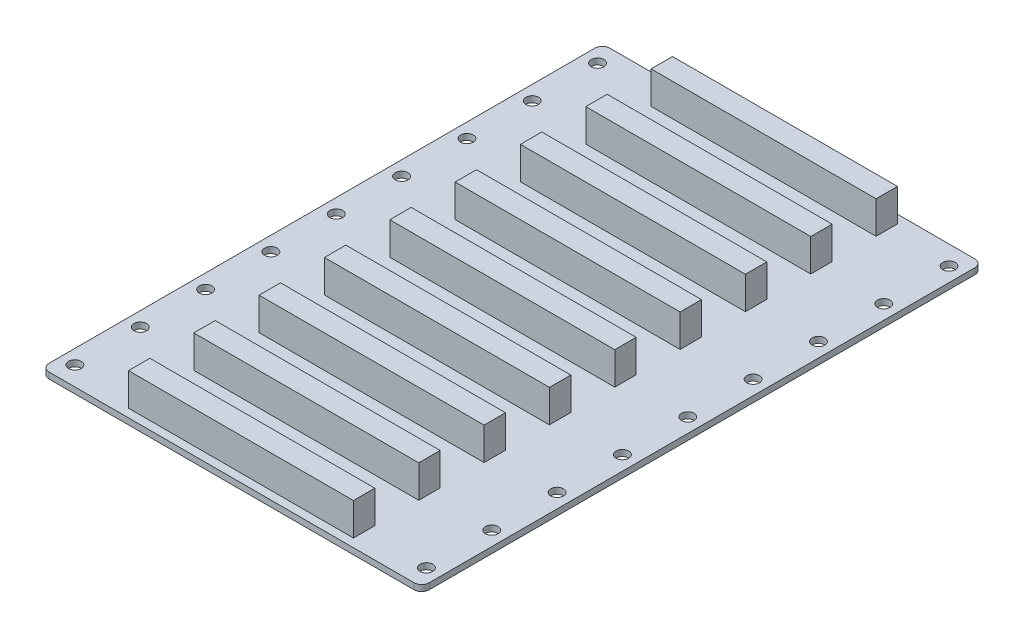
ISO-10303-21;
HEADER;
FILE_DESCRIPTION(('STEP AP214'),'2;1');
FILE_NAME('part.step','',(''),(''),'','','');
FILE_SCHEMA(('AUTOMOTIVE_DESIGN { 1 0 10303 214 1 1 1 1 }'));
ENDSEC;
DATA;
#1=APPLICATION_CONTEXT('core data for automotive mechanical design processes');
#2=APPLICATION_PROTOCOL_DEFINITION('international standard','automotive_design',2000,#1);
#3=PRODUCT_CONTEXT('',#1,'mechanical');
#4=PRODUCT('Part','Part','',(#3));
#5=PRODUCT_RELATED_PRODUCT_CATEGORY('part','',(#4));
#6=PRODUCT_DEFINITION_FORMATION('','',#4);
#7=PRODUCT_DEFINITION_CONTEXT('part definition',#1,'design');
#8=PRODUCT_DEFINITION('design','',#6,#7);
#9=PRODUCT_DEFINITION_SHAPE('','',#8);
#10=(LENGTH_UNIT() NAMED_UNIT(*) SI_UNIT(.MILLI.,.METRE.));
#11=(NAMED_UNIT(*) PLANE_ANGLE_UNIT() SI_UNIT($,.RADIAN.));
#12=(NAMED_UNIT(*) SI_UNIT($,.STERADIAN.) SOLID_ANGLE_UNIT());
#13=UNCERTAINTY_MEASURE_WITH_UNIT(LENGTH_MEASURE(1.E-05),#10,'distance_accuracy_value','');
#14=(GEOMETRIC_REPRESENTATION_CONTEXT(3) GLOBAL_UNCERTAINTY_ASSIGNED_CONTEXT((#13)) GLOBAL_UNIT_ASSIGNED_CONTEXT((#10,
#11,#12)) REPRESENTATION_CONTEXT('',''));
#15=CARTESIAN_POINT('',(0.,0.,0.));
#16=DIRECTION('',(0.,0.,1.));
#17=DIRECTION('',(1.,0.,0.));
#18=AXIS2_PLACEMENT_3D('',#15,#16,#17);
#19=CARTESIAN_POINT('',(0.,1.6,0.));
#20=DIRECTION('',(0.,-1.,0.));
#21=DIRECTION('',(0.,0.,-1.));
#22=AXIS2_PLACEMENT_3D('',#19,#20,#21);
#23=PLANE('',#22);
#24=DIRECTION('',(-1.,0.,0.));
#25=VECTOR('',#24,1.);
#26=CARTESIAN_POINT('',(-29.195,1.6,-54.0999999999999));
#27=LINE('',#26,#25);
#28=CARTESIAN_POINT('',(29.695,1.6,-54.0999999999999));
#29=VERTEX_POINT('',#28);
#30=CARTESIAN_POINT('',(-29.195,1.6,-54.0999999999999));
#31=VERTEX_POINT('',#30);
#32=EDGE_CURVE('E342',#29,#31,#27,.T.);
#33=ORIENTED_EDGE('',*,*,#32,.F.);
#34=DIRECTION('',(0.,0.,-1.));
#35=VECTOR('',#34,1.);
#36=CARTESIAN_POINT('',(29.695,1.6,-48.4999999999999));
#37=LINE('',#36,#35);
#38=CARTESIAN_POINT('',(29.695,1.6,-48.4999999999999));
#39=VERTEX_POINT('',#38);
#40=EDGE_CURVE('E355',#39,#29,#37,.T.);
#41=ORIENTED_EDGE('',*,*,#40,.F.);
#42=DIRECTION('',(1.,0.,0.));
#43=VECTOR('',#42,1.);
#44=CARTESIAN_POINT('',(-29.195,1.6,-48.4999999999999));
#45=LINE('',#44,#43);
#46=CARTESIAN_POINT('',(-29.195,1.6,-48.4999999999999));
#47=VERTEX_POINT('',#46);
#48=EDGE_CURVE('E364',#47,#39,#45,.T.);
#49=ORIENTED_EDGE('',*,*,#48,.F.);
#50=DIRECTION('',(0.,0.,1.));
#51=VECTOR('',#50,1.);
#52=CARTESIAN_POINT('',(-29.195,1.6,-48.4999999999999));
#53=LINE('',#52,#51);
#54=EDGE_CURVE('E345',#31,#47,#53,.T.);
#55=ORIENTED_EDGE('',*,*,#54,.F.);
#56=EDGE_LOOP('',(#33,#41,#49,#55));
#57=FACE_BOUND('',#56,.T.);
#58=DIRECTION('',(-1.,0.,0.));
#59=VECTOR('',#58,1.);
#60=CARTESIAN_POINT('',(-29.195,1.6,-19.8999999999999));
#61=LINE('',#60,#59);
#62=CARTESIAN_POINT('',(29.695,1.6,-19.8999999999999));
#63=VERTEX_POINT('',#62);
#64=CARTESIAN_POINT('',(-29.195,1.6,-19.8999999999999));
#65=VERTEX_POINT('',#64);
#66=EDGE_CURVE('E413',#63,#65,#61,.T.);
#67=ORIENTED_EDGE('',*,*,#66,.F.);
#68=DIRECTION('',(0.,0.,-1.));
#69=VECTOR('',#68,1.);
#70=CARTESIAN_POINT('',(29.695,1.6,-14.3));
#71=LINE('',#70,#69);
#72=CARTESIAN_POINT('',(29.695,1.6,-14.3));
#73=VERTEX_POINT('',#72);
#74=EDGE_CURVE('E418',#73,#63,#71,.T.);
#75=ORIENTED_EDGE('',*,*,#74,.F.);
#76=DIRECTION('',(1.,0.,0.));
#77=VECTOR('',#76,1.);
#78=CARTESIAN_POINT('',(-29.195,1.6,-14.3));
#79=LINE('',#78,#77);
#80=CARTESIAN_POINT('',(-29.195,1.6,-14.3));
#81=VERTEX_POINT('',#80);
#82=EDGE_CURVE('E430',#81,#73,#79,.T.);
#83=ORIENTED_EDGE('',*,*,#82,.F.);
#84=DIRECTION('',(0.,0.,1.));
#85=VECTOR('',#84,1.);
#86=CARTESIAN_POINT('',(-29.195,1.6,-14.3));
#87=LINE('',#86,#85);
#88=EDGE_CURVE('E427',#65,#81,#87,.T.);
#89=ORIENTED_EDGE('',*,*,#88,.F.);
#90=EDGE_LOOP('',(#67,#75,#83,#89));
#91=FACE_BOUND('',#90,.T.);
#92=DIRECTION('',(-1.,0.,0.));
#93=VECTOR('',#92,1.);
#94=CARTESIAN_POINT('',(-29.195,1.6,14.3));
#95=LINE('',#94,#93);
#96=CARTESIAN_POINT('',(29.695,1.6,14.3));
#97=VERTEX_POINT('',#96);
#98=CARTESIAN_POINT('',(-29.195,1.6,14.3));
#99=VERTEX_POINT('',#98);
#100=EDGE_CURVE('E479',#97,#99,#95,.T.);
#101=ORIENTED_EDGE('',*,*,#100,.F.);
#102=DIRECTION('',(0.,0.,-1.));
#103=VECTOR('',#102,1.);
#104=CARTESIAN_POINT('',(29.695,1.6,19.9));
#105=LINE('',#104,#103);
#106=CARTESIAN_POINT('',(29.695,1.6,19.9));
#107=VERTEX_POINT('',#106);
#108=EDGE_CURVE('E484',#107,#97,#105,.T.);
#109=ORIENTED_EDGE('',*,*,#108,.F.);
#110=DIRECTION('',(1.,0.,0.));
#111=VECTOR('',#110,1.);
#112=CARTESIAN_POINT('',(-29.195,1.6,19.9));
#113=LINE('',#112,#111);
#114=CARTESIAN_POINT('',(-29.195,1.6,19.9));
#115=VERTEX_POINT('',#114);
#116=EDGE_CURVE('E496',#115,#107,#113,.T.);
#117=ORIENTED_EDGE('',*,*,#116,.F.);
#118=DIRECTION('',(0.,0.,1.));
#119=VECTOR('',#118,1.);
#120=CARTESIAN_POINT('',(-29.195,1.6,19.9));
#121=LINE('',#120,#119);
#122=EDGE_CURVE('E493',#99,#115,#121,.T.);
#123=ORIENTED_EDGE('',*,*,#122,.F.);
#124=EDGE_LOOP('',(#101,#109,#117,#123));
#125=FACE_BOUND('',#124,.T.);
#126=DIRECTION('',(-1.,0.,0.));
#127=VECTOR('',#126,1.);
#128=CARTESIAN_POINT('',(-29.195,1.6,48.5));
#129=LINE('',#128,#127);
#130=CARTESIAN_POINT('',(29.695,1.6,48.5));
#131=VERTEX_POINT('',#130);
#132=CARTESIAN_POINT('',(-29.195,1.6,48.5));
#133=VERTEX_POINT('',#132);
#134=EDGE_CURVE('E545',#131,#133,#129,.T.);
#135=ORIENTED_EDGE('',*,*,#134,.F.);
#136=DIRECTION('',(0.,0.,-1.));
#137=VECTOR('',#136,1.);
#138=CARTESIAN_POINT('',(29.695,1.6,54.1));
#139=LINE('',#138,#137);
#140=CARTESIAN_POINT('',(29.695,1.6,54.1));
#141=VERTEX_POINT('',#140);
#142=EDGE_CURVE('E550',#141,#131,#139,.T.);
#143=ORIENTED_EDGE('',*,*,#142,.F.);
#144=DIRECTION('',(1.,0.,0.));
#145=VECTOR('',#144,1.);
#146=CARTESIAN_POINT('',(-29.195,1.6,54.1));
#147=LINE('',#146,#145);
#148=CARTESIAN_POINT('',(-29.195,1.6,54.1));
#149=VERTEX_POINT('',#148);
#150=EDGE_CURVE('E562',#149,#141,#147,.T.);
#151=ORIENTED_EDGE('',*,*,#150,.F.);
#152=DIRECTION('',(0.,0.,1.));
#153=VECTOR('',#152,1.);
#154=CARTESIAN_POINT('',(-29.195,1.6,54.1));
#155=LINE('',#154,#153);
#156=EDGE_CURVE('E559',#133,#149,#155,.T.);
#157=ORIENTED_EDGE('',*,*,#156,.F.);
#158=EDGE_LOOP('',(#135,#143,#151,#157));
#159=FACE_BOUND('',#158,.T.);
#160=DIRECTION('',(-1.,0.,0.));
#161=VECTOR('',#160,1.);
#162=CARTESIAN_POINT('',(-49.75,1.6,-73.4));
#163=LINE('',#162,#161);
#164=CARTESIAN_POINT('',(47.75,1.6,-73.4));
#165=VERTEX_POINT('',#164);
#166=CARTESIAN_POINT('',(-47.75,1.6,-73.4));
#167=VERTEX_POINT('',#166);
#168=EDGE_CURVE('E723',#165,#167,#163,.T.);
#169=ORIENTED_EDGE('',*,*,#168,.T.);
#170=CARTESIAN_POINT('',(-47.75,1.6,-71.4));
#171=DIRECTION('',(0.,-1.,0.));
#172=DIRECTION('',(0.,0.,-1.));
#173=AXIS2_PLACEMENT_3D('',#170,#171,#172);
#174=CIRCLE('',#173,2.);
#175=CARTESIAN_POINT('',(-49.75,1.6,-71.4));
#176=VERTEX_POINT('',#175);
#177=EDGE_CURVE('E763',#167,#176,#174,.F.);
#178=ORIENTED_EDGE('',*,*,#177,.T.);
#179=DIRECTION('',(0.,0.,1.));
#180=VECTOR('',#179,1.);
#181=CARTESIAN_POINT('',(-49.75,1.6,73.4));
#182=LINE('',#181,#180);
#183=CARTESIAN_POINT('',(-49.75,1.6,71.4));
#184=VERTEX_POINT('',#183);
#185=EDGE_CURVE('E727',#176,#184,#182,.T.);
#186=ORIENTED_EDGE('',*,*,#185,.T.);
#187=CARTESIAN_POINT('',(-47.75,1.6,71.4));
#188=DIRECTION('',(0.,-1.,0.));
#189=DIRECTION('',(0.,0.,-1.));
#190=AXIS2_PLACEMENT_3D('',#187,#188,#189);
#191=CIRCLE('',#190,2.);
#192=CARTESIAN_POINT('',(-47.75,1.6,73.4));
#193=VERTEX_POINT('',#192);
#194=EDGE_CURVE('E56',#184,#193,#191,.F.);
#195=ORIENTED_EDGE('',*,*,#194,.T.);
#196=DIRECTION('',(1.,0.,0.));
#197=VECTOR('',#196,1.);
#198=CARTESIAN_POINT('',(-49.75,1.6,73.4));
#199=LINE('',#198,#197);
#200=CARTESIAN_POINT('',(47.75,1.6,73.4));
#201=VERTEX_POINT('',#200);
#202=EDGE_CURVE('E729',#193,#201,#199,.T.);
#203=ORIENTED_EDGE('',*,*,#202,.T.);
#204=CARTESIAN_POINT('',(47.75,1.6,71.4));
#205=DIRECTION('',(0.,-1.,0.));
#206=DIRECTION('',(0.,0.,-1.));
#207=AXIS2_PLACEMENT_3D('',#204,#205,#206);
#208=CIRCLE('',#207,2.);
#209=CARTESIAN_POINT('',(49.75,1.6,71.4));
#210=VERTEX_POINT('',#209);
#211=EDGE_CURVE('E759',#201,#210,#208,.F.);
#212=ORIENTED_EDGE('',*,*,#211,.T.);
#213=DIRECTION('',(0.,0.,-1.));
#214=VECTOR('',#213,1.);
#215=CARTESIAN_POINT('',(49.75,1.6,73.4));
#216=LINE('',#215,#214);
#217=CARTESIAN_POINT('',(49.75,1.6,-71.4));
#218=VERTEX_POINT('',#217);
#219=EDGE_CURVE('E720',#210,#218,#216,.T.);
#220=ORIENTED_EDGE('',*,*,#219,.T.);
#221=CARTESIAN_POINT('',(47.75,1.6,-71.4));
#222=DIRECTION('',(0.,-1.,0.));
#223=DIRECTION('',(0.,0.,-1.));
#224=AXIS2_PLACEMENT_3D('',#221,#222,#223);
#225=CIRCLE('',#224,2.);
#226=EDGE_CURVE('E761',#218,#165,#225,.F.);
#227=ORIENTED_EDGE('',*,*,#226,.T.);
#228=EDGE_LOOP('',(#169,#178,#186,#195,#203,#212,#220,#227));
#229=FACE_BOUND('',#228,.T.);
#230=CARTESIAN_POINT('',(-46.,1.6,68.4));
#231=DIRECTION('',(0.,1.,0.));
#232=DIRECTION('',(0.,0.,1.));
#233=AXIS2_PLACEMENT_3D('',#230,#231,#232);
#234=CIRCLE('',#233,1.65);
#235=CARTESIAN_POINT('',(-46.,1.6,70.05));
#236=VERTEX_POINT('',#235);
#237=EDGE_CURVE('E693',#236,#236,#234,.T.);
#238=ORIENTED_EDGE('',*,*,#237,.F.);
#239=EDGE_LOOP('',(#238));
#240=FACE_BOUND('',#239,.T.);
#241=CARTESIAN_POINT('',(46.,1.6,51.3));
#242=DIRECTION('',(0.,1.,0.));
#243=DIRECTION('',(0.,0.,-1.));
#244=AXIS2_PLACEMENT_3D('',#241,#242,#243);
#245=CIRCLE('',#244,1.65);
#246=CARTESIAN_POINT('',(46.,1.6,49.65));
#247=VERTEX_POINT('',#246);
#248=EDGE_CURVE('E656',#247,#247,#245,.T.);
#249=ORIENTED_EDGE('',*,*,#248,.F.);
#250=EDGE_LOOP('',(#249));
#251=FACE_BOUND('',#250,.T.);
#252=CARTESIAN_POINT('',(46.,1.6,34.2));
#253=DIRECTION('',(0.,1.,0.));
#254=DIRECTION('',(0.,0.,-1.));
#255=AXIS2_PLACEMENT_3D('',#252,#253,#254);
#256=CIRCLE('',#255,1.65);
#257=CARTESIAN_POINT('',(46.,1.6,32.55));
#258=VERTEX_POINT('',#257);
#259=EDGE_CURVE('E650',#258,#258,#256,.T.);
#260=ORIENTED_EDGE('',*,*,#259,.F.);
#261=EDGE_LOOP('',(#260));
#262=FACE_BOUND('',#261,.T.);
#263=CARTESIAN_POINT('',(46.,1.6,17.1));
#264=DIRECTION('',(0.,1.,0.));
#265=DIRECTION('',(0.,0.,-1.));
#266=AXIS2_PLACEMENT_3D('',#263,#264,#265);
#267=CIRCLE('',#266,1.65);
#268=CARTESIAN_POINT('',(46.,1.6,15.45));
#269=VERTEX_POINT('',#268);
#270=EDGE_CURVE('E644',#269,#269,#267,.T.);
#271=ORIENTED_EDGE('',*,*,#270,.F.);
#272=EDGE_LOOP('',(#271));
#273=FACE_BOUND('',#272,.T.);
#274=CARTESIAN_POINT('',(46.,1.6,0.));
#275=DIRECTION('',(0.,1.,0.));
#276=DIRECTION('',(0.,0.,-1.));
#277=AXIS2_PLACEMENT_3D('',#274,#275,#276);
#278=CIRCLE('',#277,1.65);
#279=CARTESIAN_POINT('',(46.,1.6,-1.65));
#280=VERTEX_POINT('',#279);
#281=EDGE_CURVE('E638',#280,#280,#278,.T.);
#282=ORIENTED_EDGE('',*,*,#281,.F.);
#283=EDGE_LOOP('',(#282));
#284=FACE_BOUND('',#283,.T.);
#285=CARTESIAN_POINT('',(46.,1.6,-17.1));
#286=DIRECTION('',(0.,1.,0.));
#287=DIRECTION('',(0.,0.,-1.));
#288=AXIS2_PLACEMENT_3D('',#285,#286,#287);
#289=CIRCLE('',#288,1.65);
#290=CARTESIAN_POINT('',(46.,1.6,-18.75));
#291=VERTEX_POINT('',#290);
#292=EDGE_CURVE('E632',#291,#291,#289,.T.);
#293=ORIENTED_EDGE('',*,*,#292,.F.);
#294=EDGE_LOOP('',(#293));
#295=FACE_BOUND('',#294,.T.);
#296=CARTESIAN_POINT('',(46.,1.6,-34.2));
#297=DIRECTION('',(0.,1.,0.));
#298=DIRECTION('',(0.,0.,-1.));
#299=AXIS2_PLACEMENT_3D('',#296,#297,#298);
#300=CIRCLE('',#299,1.65);
#301=CARTESIAN_POINT('',(46.,1.6,-35.85));
#302=VERTEX_POINT('',#301);
#303=EDGE_CURVE('E626',#302,#302,#300,.T.);
#304=ORIENTED_EDGE('',*,*,#303,.F.);
#305=EDGE_LOOP('',(#304));
#306=FACE_BOUND('',#305,.T.);
#307=CARTESIAN_POINT('',(-46.,1.6,-68.4));
#308=DIRECTION('',(0.,1.,0.));
#309=DIRECTION('',(0.,0.,1.));
#310=AXIS2_PLACEMENT_3D('',#307,#308,#309);
#311=CIRCLE('',#310,1.65);
#312=CARTESIAN_POINT('',(-46.,1.6,-66.75));
#313=VERTEX_POINT('',#312);
#314=EDGE_CURVE('E620',#313,#313,#311,.T.);
#315=ORIENTED_EDGE('',*,*,#314,.F.);
#316=EDGE_LOOP('',(#315));
#317=FACE_BOUND('',#316,.T.);
#318=CARTESIAN_POINT('',(-46.,1.6,-51.3));
#319=DIRECTION('',(0.,1.,0.));
#320=DIRECTION('',(0.,0.,1.));
#321=AXIS2_PLACEMENT_3D('',#318,#319,#320);
#322=CIRCLE('',#321,1.65);
#323=CARTESIAN_POINT('',(-46.,1.6,-49.65));
#324=VERTEX_POINT('',#323);
#325=EDGE_CURVE('E612',#324,#324,#322,.T.);
#326=ORIENTED_EDGE('',*,*,#325,.F.);
#327=EDGE_LOOP('',(#326));
#328=FACE_BOUND('',#327,.T.);
#329=CARTESIAN_POINT('',(46.,1.6,-68.4));
#330=DIRECTION('',(0.,1.,0.));
#331=DIRECTION('',(0.,0.,-1.));
#332=AXIS2_PLACEMENT_3D('',#329,#330,#331);
#333=CIRCLE('',#332,1.65);
#334=CARTESIAN_POINT('',(46.,1.6,-70.05));
#335=VERTEX_POINT('',#334);
#336=EDGE_CURVE('E686',#335,#335,#333,.T.);
#337=ORIENTED_EDGE('',*,*,#336,.F.);
#338=EDGE_LOOP('',(#337));
#339=FACE_BOUND('',#338,.T.);
#340=CARTESIAN_POINT('',(46.,1.6,-51.3));
#341=DIRECTION('',(0.,1.,0.));
#342=DIRECTION('',(0.,0.,-1.));
#343=AXIS2_PLACEMENT_3D('',#340,#341,#342);
#344=CIRCLE('',#343,1.65);
#345=CARTESIAN_POINT('',(46.,1.6,-52.95));
#346=VERTEX_POINT('',#345);
#347=EDGE_CURVE('E694',#346,#346,#344,.T.);
#348=ORIENTED_EDGE('',*,*,#347,.F.);
#349=EDGE_LOOP('',(#348));
#350=FACE_BOUND('',#349,.T.);
#351=CARTESIAN_POINT('',(-46.,1.6,51.3));
#352=DIRECTION('',(0.,1.,0.));
#353=DIRECTION('',(0.,0.,1.));
#354=AXIS2_PLACEMENT_3D('',#351,#352,#353);
#355=CIRCLE('',#354,1.65);
#356=CARTESIAN_POINT('',(-46.,1.6,52.95));
#357=VERTEX_POINT('',#356);
#358=EDGE_CURVE('E700',#357,#357,#355,.T.);
#359=ORIENTED_EDGE('',*,*,#358,.F.);
#360=EDGE_LOOP('',(#359));
#361=FACE_BOUND('',#360,.T.);
#362=CARTESIAN_POINT('',(-46.,1.6,34.2));
#363=DIRECTION('',(0.,1.,0.));
#364=DIRECTION('',(0.,0.,1.));
#365=AXIS2_PLACEMENT_3D('',#362,#363,#364);
#366=CIRCLE('',#365,1.65);
#367=CARTESIAN_POINT('',(-46.,1.6,35.85));
#368=VERTEX_POINT('',#367);
#369=EDGE_CURVE('E669',#368,#368,#366,.T.);
#370=ORIENTED_EDGE('',*,*,#369,.F.);
#371=EDGE_LOOP('',(#370));
#372=FACE_BOUND('',#371,.T.);
#373=CARTESIAN_POINT('',(-46.,1.6,17.1));
#374=DIRECTION('',(0.,1.,0.));
#375=DIRECTION('',(0.,0.,1.));
#376=AXIS2_PLACEMENT_3D('',#373,#374,#375);
#377=CIRCLE('',#376,1.65);
#378=CARTESIAN_POINT('',(-46.,1.6,18.75));
#379=VERTEX_POINT('',#378);
#380=EDGE_CURVE('E662',#379,#379,#377,.T.);
#381=ORIENTED_EDGE('',*,*,#380,.F.);
#382=EDGE_LOOP('',(#381));
#383=FACE_BOUND('',#382,.T.);
#384=CARTESIAN_POINT('',(-46.,1.6,0.));
#385=DIRECTION('',(0.,1.,0.));
#386=DIRECTION('',(0.,0.,1.));
#387=AXIS2_PLACEMENT_3D('',#384,#385,#386);
#388=CIRCLE('',#387,1.65);
#389=CARTESIAN_POINT('',(-46.,1.6,1.65000000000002));
#390=VERTEX_POINT('',#389);
#391=EDGE_CURVE('E670',#390,#390,#388,.T.);
#392=ORIENTED_EDGE('',*,*,#391,.F.);
#393=EDGE_LOOP('',(#392));
#394=FACE_BOUND('',#393,.T.);
#395=CARTESIAN_POINT('',(-46.,1.6,-17.1));
#396=DIRECTION('',(0.,1.,0.));
#397=DIRECTION('',(0.,0.,1.));
#398=AXIS2_PLACEMENT_3D('',#395,#396,#397);
#399=CIRCLE('',#398,1.65);
#400=CARTESIAN_POINT('',(-46.,1.6,-15.45));
#401=VERTEX_POINT('',#400);
#402=EDGE_CURVE('E676',#401,#401,#399,.T.);
#403=ORIENTED_EDGE('',*,*,#402,.F.);
#404=EDGE_LOOP('',(#403));
#405=FACE_BOUND('',#404,.T.);
#406=CARTESIAN_POINT('',(-46.,1.6,-34.2));
#407=DIRECTION('',(0.,1.,0.));
#408=DIRECTION('',(0.,0.,1.));
#409=AXIS2_PLACEMENT_3D('',#406,#407,#408);
#410=CIRCLE('',#409,1.65);
#411=CARTESIAN_POINT('',(-46.,1.6,-32.55));
#412=VERTEX_POINT('',#411);
#413=EDGE_CURVE('E619',#412,#412,#410,.T.);
#414=ORIENTED_EDGE('',*,*,#413,.F.);
#415=EDGE_LOOP('',(#414));
#416=FACE_BOUND('',#415,.T.);
#417=CARTESIAN_POINT('',(46.,1.6,68.4));
#418=DIRECTION('',(0.,1.,0.));
#419=DIRECTION('',(0.,0.,-1.));
#420=AXIS2_PLACEMENT_3D('',#417,#418,#419);
#421=CIRCLE('',#420,1.65);
#422=CARTESIAN_POINT('',(46.,1.6,66.75));
#423=VERTEX_POINT('',#422);
#424=EDGE_CURVE('E611',#423,#423,#421,.T.);
#425=ORIENTED_EDGE('',*,*,#424,.F.);
#426=EDGE_LOOP('',(#425));
#427=FACE_BOUND('',#426,.T.);
#428=DIRECTION('',(0.,0.,-1.));
#429=VECTOR('',#428,1.);
#430=CARTESIAN_POINT('',(29.695,1.6,71.2));
#431=LINE('',#430,#429);
#432=CARTESIAN_POINT('',(29.695,1.6,71.2));
#433=VERTEX_POINT('',#432);
#434=CARTESIAN_POINT('',(29.695,1.6,65.6));
#435=VERTEX_POINT('',#434);
#436=EDGE_CURVE('E578',#433,#435,#431,.T.);
#437=ORIENTED_EDGE('',*,*,#436,.F.);
#438=DIRECTION('',(1.,0.,0.));
#439=VECTOR('',#438,1.);
#440=CARTESIAN_POINT('',(-29.195,1.6,71.2));
#441=LINE('',#440,#439);
#442=CARTESIAN_POINT('',(-29.195,1.6,71.2));
#443=VERTEX_POINT('',#442);
#444=EDGE_CURVE('E583',#443,#433,#441,.T.);
#445=ORIENTED_EDGE('',*,*,#444,.F.);
#446=DIRECTION('',(0.,0.,1.));
#447=VECTOR('',#446,1.);
#448=CARTESIAN_POINT('',(-29.195,1.6,71.2));
#449=LINE('',#448,#447);
#450=CARTESIAN_POINT('',(-29.195,1.6,65.6));
#451=VERTEX_POINT('',#450);
#452=EDGE_CURVE('E595',#451,#443,#449,.T.);
#453=ORIENTED_EDGE('',*,*,#452,.F.);
#454=DIRECTION('',(-1.,0.,0.));
#455=VECTOR('',#454,1.);
#456=CARTESIAN_POINT('',(-29.195,1.6,65.6));
#457=LINE('',#456,#455);
#458=EDGE_CURVE('E592',#435,#451,#457,.T.);
#459=ORIENTED_EDGE('',*,*,#458,.F.);
#460=EDGE_LOOP('',(#437,#445,#453,#459));
#461=FACE_BOUND('',#460,.T.);
#462=DIRECTION('',(-1.,0.,0.));
#463=VECTOR('',#462,1.);
#464=CARTESIAN_POINT('',(-29.195,1.6,31.4));
#465=LINE('',#464,#463);
#466=CARTESIAN_POINT('',(29.695,1.6,31.4));
#467=VERTEX_POINT('',#466);
#468=CARTESIAN_POINT('',(-29.195,1.6,31.4));
#469=VERTEX_POINT('',#468);
#470=EDGE_CURVE('E512',#467,#469,#465,.T.);
#471=ORIENTED_EDGE('',*,*,#470,.F.);
#472=DIRECTION('',(0.,0.,-1.));
#473=VECTOR('',#472,1.);
#474=CARTESIAN_POINT('',(29.695,1.6,37.));
#475=LINE('',#474,#473);
#476=CARTESIAN_POINT('',(29.695,1.6,37.));
#477=VERTEX_POINT('',#476);
#478=EDGE_CURVE('E517',#477,#467,#475,.T.);
#479=ORIENTED_EDGE('',*,*,#478,.F.);
#480=DIRECTION('',(1.,0.,0.));
#481=VECTOR('',#480,1.);
#482=CARTESIAN_POINT('',(-29.195,1.6,37.));
#483=LINE('',#482,#481);
#484=CARTESIAN_POINT('',(-29.195,1.6,37.));
#485=VERTEX_POINT('',#484);
#486=EDGE_CURVE('E529',#485,#477,#483,.T.);
#487=ORIENTED_EDGE('',*,*,#486,.F.);
#488=DIRECTION('',(0.,0.,1.));
#489=VECTOR('',#488,1.);
#490=CARTESIAN_POINT('',(-29.195,1.6,37.));
#491=LINE('',#490,#489);
#492=EDGE_CURVE('E526',#469,#485,#491,.T.);
#493=ORIENTED_EDGE('',*,*,#492,.F.);
#494=EDGE_LOOP('',(#471,#479,#487,#493));
#495=FACE_BOUND('',#494,.T.);
#496=DIRECTION('',(-1.,0.,0.));
#497=VECTOR('',#496,1.);
#498=CARTESIAN_POINT('',(-29.195,1.6,-2.79999999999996));
#499=LINE('',#498,#497);
#500=CARTESIAN_POINT('',(29.695,1.6,-2.79999999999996));
#501=VERTEX_POINT('',#500);
#502=CARTESIAN_POINT('',(-29.195,1.6,-2.79999999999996));
#503=VERTEX_POINT('',#502);
#504=EDGE_CURVE('E446',#501,#503,#499,.T.);
#505=ORIENTED_EDGE('',*,*,#504,.F.);
#506=DIRECTION('',(0.,0.,-1.));
#507=VECTOR('',#506,1.);
#508=CARTESIAN_POINT('',(29.695,1.6,2.80000000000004));
#509=LINE('',#508,#507);
#510=CARTESIAN_POINT('',(29.695,1.6,2.80000000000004));
#511=VERTEX_POINT('',#510);
#512=EDGE_CURVE('E451',#511,#501,#509,.T.);
#513=ORIENTED_EDGE('',*,*,#512,.F.);
#514=DIRECTION('',(1.,0.,0.));
#515=VECTOR('',#514,1.);
#516=CARTESIAN_POINT('',(-29.195,1.6,2.80000000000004));
#517=LINE('',#516,#515);
#518=CARTESIAN_POINT('',(-29.195,1.6,2.80000000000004));
#519=VERTEX_POINT('',#518);
#520=EDGE_CURVE('E463',#519,#511,#517,.T.);
#521=ORIENTED_EDGE('',*,*,#520,.F.);
#522=DIRECTION('',(0.,0.,1.));
#523=VECTOR('',#522,1.);
#524=CARTESIAN_POINT('',(-29.195,1.6,2.80000000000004));
#525=LINE('',#524,#523);
#526=EDGE_CURVE('E460',#503,#519,#525,.T.);
#527=ORIENTED_EDGE('',*,*,#526,.F.);
#528=EDGE_LOOP('',(#505,#513,#521,#527));
#529=FACE_BOUND('',#528,.T.);
#530=DIRECTION('',(-1.,0.,0.));
#531=VECTOR('',#530,1.);
#532=CARTESIAN_POINT('',(-29.195,1.6,-36.9999999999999));
#533=LINE('',#532,#531);
#534=CARTESIAN_POINT('',(29.695,1.6,-36.9999999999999));
#535=VERTEX_POINT('',#534);
#536=CARTESIAN_POINT('',(-29.195,1.6,-36.9999999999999));
#537=VERTEX_POINT('',#536);
#538=EDGE_CURVE('E380',#535,#537,#533,.T.);
#539=ORIENTED_EDGE('',*,*,#538,.F.);
#540=DIRECTION('',(0.,0.,-1.));
#541=VECTOR('',#540,1.);
#542=CARTESIAN_POINT('',(29.695,1.6,-31.3999999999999));
#543=LINE('',#542,#541);
#544=CARTESIAN_POINT('',(29.695,1.6,-31.3999999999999));
#545=VERTEX_POINT('',#544);
#546=EDGE_CURVE('E385',#545,#535,#543,.T.);
#547=ORIENTED_EDGE('',*,*,#546,.F.);
#548=DIRECTION('',(1.,0.,0.));
#549=VECTOR('',#548,1.);
#550=CARTESIAN_POINT('',(-29.195,1.6,-31.3999999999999));
#551=LINE('',#550,#549);
#552=CARTESIAN_POINT('',(-29.195,1.6,-31.3999999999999));
#553=VERTEX_POINT('',#552);
#554=EDGE_CURVE('E397',#553,#545,#551,.T.);
#555=ORIENTED_EDGE('',*,*,#554,.F.);
#556=DIRECTION('',(0.,0.,1.));
#557=VECTOR('',#556,1.);
#558=CARTESIAN_POINT('',(-29.195,1.6,-31.3999999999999));
#559=LINE('',#558,#557);
#560=EDGE_CURVE('E394',#537,#553,#559,.T.);
#561=ORIENTED_EDGE('',*,*,#560,.F.);
#562=EDGE_LOOP('',(#539,#547,#555,#561));
#563=FACE_BOUND('',#562,.T.);
#564=DIRECTION('',(-1.,0.,0.));
#565=VECTOR('',#564,1.);
#566=CARTESIAN_POINT('',(-29.195,1.6,-71.1999999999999));
#567=LINE('',#566,#565);
#568=CARTESIAN_POINT('',(29.695,1.6,-71.1999999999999));
#569=VERTEX_POINT('',#568);
#570=CARTESIAN_POINT('',(-29.195,1.6,-71.1999999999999));
#571=VERTEX_POINT('',#570);
#572=EDGE_CURVE('E341',#569,#571,#567,.T.);
#573=ORIENTED_EDGE('',*,*,#572,.F.);
#574=DIRECTION('',(0.,0.,-1.));
#575=VECTOR('',#574,1.);
#576=CARTESIAN_POINT('',(29.695,1.6,-65.5999999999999));
#577=LINE('',#576,#575);
#578=CARTESIAN_POINT('',(29.695,1.6,-65.5999999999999));
#579=VERTEX_POINT('',#578);
#580=EDGE_CURVE('E338',#579,#569,#577,.T.);
#581=ORIENTED_EDGE('',*,*,#580,.F.);
#582=DIRECTION('',(1.,0.,0.));
#583=VECTOR('',#582,1.);
#584=CARTESIAN_POINT('',(-29.195,1.6,-65.5999999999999));
#585=LINE('',#584,#583);
#586=CARTESIAN_POINT('',(-29.195,1.6,-65.5999999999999));
#587=VERTEX_POINT('',#586);
#588=EDGE_CURVE('E1559',#587,#579,#585,.T.);
#589=ORIENTED_EDGE('',*,*,#588,.F.);
#590=DIRECTION('',(0.,0.,1.));
#591=VECTOR('',#590,1.);
#592=CARTESIAN_POINT('',(-29.195,1.6,-65.5999999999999));
#593=LINE('',#592,#591);
#594=EDGE_CURVE('E1554',#571,#587,#593,.T.);
#595=ORIENTED_EDGE('',*,*,#594,.F.);
#596=EDGE_LOOP('',(#573,#581,#589,#595));
#597=FACE_BOUND('',#596,.T.);
#598=ADVANCED_FACE('F36',(#57,#91,#125,#159,#229,#240,#251,#262,#273,#284,#295,#306,#317,#328,
#339,#350,#361,#372,#383,#394,#405,#416,#427,#461,#495,#529,#563,#597),#23,.F.);
#599=CARTESIAN_POINT('',(49.75,1.6,73.4));
#600=DIRECTION('',(-1.,0.,0.));
#601=DIRECTION('',(0.,0.,1.));
#602=AXIS2_PLACEMENT_3D('',#599,#600,#601);
#603=PLANE('',#602);
#604=DIRECTION('',(0.,0.,-1.));
#605=VECTOR('',#604,1.);
#606=CARTESIAN_POINT('',(49.75,0.,73.4));
#607=LINE('',#606,#605);
#608=CARTESIAN_POINT('',(49.75,0.,71.4));
#609=VERTEX_POINT('',#608);
#610=CARTESIAN_POINT('',(49.75,0.,-71.4));
#611=VERTEX_POINT('',#610);
#612=EDGE_CURVE('E719',#609,#611,#607,.T.);
#613=ORIENTED_EDGE('',*,*,#612,.T.);
#614=DIRECTION('',(0.,-1.,0.));
#615=VECTOR('',#614,1.);
#616=CARTESIAN_POINT('',(49.75,1.6,-71.4));
#617=LINE('',#616,#615);
#618=EDGE_CURVE('E768',#611,#218,#617,.F.);
#619=ORIENTED_EDGE('',*,*,#618,.T.);
#620=ORIENTED_EDGE('',*,*,#219,.F.);
#621=DIRECTION('',(0.,-1.,0.));
#622=VECTOR('',#621,1.);
#623=CARTESIAN_POINT('',(49.75,1.6,71.4));
#624=LINE('',#623,#622);
#625=EDGE_CURVE('E765',#210,#609,#624,.T.);
#626=ORIENTED_EDGE('',*,*,#625,.T.);
#627=EDGE_LOOP('',(#613,#619,#620,#626));
#628=FACE_BOUND('',#627,.T.);
#629=ADVANCED_FACE('F784',(#628),#603,.F.);
#630=CARTESIAN_POINT('',(-49.75,1.6,-73.4));
#631=DIRECTION('',(0.,0.,1.));
#632=DIRECTION('',(1.,0.,0.));
#633=AXIS2_PLACEMENT_3D('',#630,#631,#632);
#634=PLANE('',#633);
#635=DIRECTION('',(-1.,0.,0.));
#636=VECTOR('',#635,1.);
#637=CARTESIAN_POINT('',(-49.75,0.,-73.4));
#638=LINE('',#637,#636);
#639=CARTESIAN_POINT('',(47.75,0.,-73.4));
#640=VERTEX_POINT('',#639);
#641=CARTESIAN_POINT('',(-47.75,0.,-73.4));
#642=VERTEX_POINT('',#641);
#643=EDGE_CURVE('E734',#640,#642,#638,.T.);
#644=ORIENTED_EDGE('',*,*,#643,.T.);
#645=DIRECTION('',(0.,-1.,0.));
#646=VECTOR('',#645,1.);
#647=CARTESIAN_POINT('',(-47.75,1.6,-73.4));
#648=LINE('',#647,#646);
#649=EDGE_CURVE('E756',#642,#167,#648,.F.);
#650=ORIENTED_EDGE('',*,*,#649,.T.);
#651=ORIENTED_EDGE('',*,*,#168,.F.);
#652=DIRECTION('',(0.,-1.,0.));
#653=VECTOR('',#652,1.);
#654=CARTESIAN_POINT('',(47.75,1.6,-73.4));
#655=LINE('',#654,#653);
#656=EDGE_CURVE('E753',#165,#640,#655,.T.);
#657=ORIENTED_EDGE('',*,*,#656,.T.);
#658=EDGE_LOOP('',(#644,#650,#651,#657));
#659=FACE_BOUND('',#658,.T.);
#660=ADVANCED_FACE('F794',(#659),#634,.F.);
#661=CARTESIAN_POINT('',(-49.75,1.6,73.4));
#662=DIRECTION('',(1.,0.,0.));
#663=DIRECTION('',(0.,0.,-1.));
#664=AXIS2_PLACEMENT_3D('',#661,#662,#663);
#665=PLANE('',#664);
#666=ORIENTED_EDGE('',*,*,#185,.F.);
#667=DIRECTION('',(0.,-1.,0.));
#668=VECTOR('',#667,1.);
#669=CARTESIAN_POINT('',(-49.75,1.6,-71.4));
#670=LINE('',#669,#668);
#671=CARTESIAN_POINT('',(-49.75,0.,-71.4));
#672=VERTEX_POINT('',#671);
#673=EDGE_CURVE('E742',#176,#672,#670,.T.);
#674=ORIENTED_EDGE('',*,*,#673,.T.);
#675=DIRECTION('',(0.,0.,1.));
#676=VECTOR('',#675,1.);
#677=CARTESIAN_POINT('',(-49.75,0.,73.4));
#678=LINE('',#677,#676);
#679=CARTESIAN_POINT('',(-49.75,0.,71.4));
#680=VERTEX_POINT('',#679);
#681=EDGE_CURVE('E737',#672,#680,#678,.T.);
#682=ORIENTED_EDGE('',*,*,#681,.T.);
#683=DIRECTION('',(0.,-1.,0.));
#684=VECTOR('',#683,1.);
#685=CARTESIAN_POINT('',(-49.75,1.6,71.4));
#686=LINE('',#685,#684);
#687=EDGE_CURVE('E731',#680,#184,#686,.F.);
#688=ORIENTED_EDGE('',*,*,#687,.T.);
#689=EDGE_LOOP('',(#666,#674,#682,#688));
#690=FACE_BOUND('',#689,.T.);
#691=ADVANCED_FACE('F802',(#690),#665,.F.);
#692=CARTESIAN_POINT('',(-49.75,1.6,73.4));
#693=DIRECTION('',(0.,0.,-1.));
#694=DIRECTION('',(-1.,0.,0.));
#695=AXIS2_PLACEMENT_3D('',#692,#693,#694);
#696=PLANE('',#695);
#697=DIRECTION('',(1.,0.,0.));
#698=VECTOR('',#697,1.);
#699=CARTESIAN_POINT('',(-49.75,0.,73.4));
#700=LINE('',#699,#698);
#701=CARTESIAN_POINT('',(-47.75,0.,73.4));
#702=VERTEX_POINT('',#701);
#703=CARTESIAN_POINT('',(47.75,0.,73.4));
#704=VERTEX_POINT('',#703);
#705=EDGE_CURVE('E724',#702,#704,#700,.T.);
#706=ORIENTED_EDGE('',*,*,#705,.T.);
#707=DIRECTION('',(0.,-1.,0.));
#708=VECTOR('',#707,1.);
#709=CARTESIAN_POINT('',(47.75,1.6,73.4));
#710=LINE('',#709,#708);
#711=EDGE_CURVE('E11',#704,#201,#710,.F.);
#712=ORIENTED_EDGE('',*,*,#711,.T.);
#713=ORIENTED_EDGE('',*,*,#202,.F.);
#714=DIRECTION('',(0.,-1.,0.));
#715=VECTOR('',#714,1.);
#716=CARTESIAN_POINT('',(-47.75,1.6,73.4));
#717=LINE('',#716,#715);
#718=EDGE_CURVE('E44',#193,#702,#717,.T.);
#719=ORIENTED_EDGE('',*,*,#718,.T.);
#720=EDGE_LOOP('',(#706,#712,#713,#719));
#721=FACE_BOUND('',#720,.T.);
#722=ADVANCED_FACE('F772',(#721),#696,.F.);
#723=CARTESIAN_POINT('',(0.,0.,0.));
#724=DIRECTION('',(0.,-1.,0.));
#725=DIRECTION('',(0.,0.,-1.));
#726=AXIS2_PLACEMENT_3D('',#723,#724,#725);
#727=PLANE('',#726);
#728=CARTESIAN_POINT('',(46.,0.,68.4));
#729=DIRECTION('',(0.,-1.,0.));
#730=DIRECTION('',(0.,0.,-1.));
#731=AXIS2_PLACEMENT_3D('',#728,#729,#730);
#732=CIRCLE('',#731,1.65);
#733=CARTESIAN_POINT('',(46.,0.,66.75));
#734=VERTEX_POINT('',#733);
#735=EDGE_CURVE('E659',#734,#734,#732,.F.);
#736=ORIENTED_EDGE('',*,*,#735,.T.);
#737=EDGE_LOOP('',(#736));
#738=FACE_BOUND('',#737,.T.);
#739=CARTESIAN_POINT('',(-46.,0.,-34.2));
#740=DIRECTION('',(0.,-1.,0.));
#741=DIRECTION('',(0.,0.,-1.));
#742=AXIS2_PLACEMENT_3D('',#739,#740,#741);
#743=CIRCLE('',#742,1.65);
#744=CARTESIAN_POINT('',(-46.,0.,-35.85));
#745=VERTEX_POINT('',#744);
#746=EDGE_CURVE('E679',#745,#745,#743,.F.);
#747=ORIENTED_EDGE('',*,*,#746,.T.);
#748=EDGE_LOOP('',(#747));
#749=FACE_BOUND('',#748,.T.);
#750=CARTESIAN_POINT('',(-46.,0.,-17.1));
#751=DIRECTION('',(0.,-1.,0.));
#752=DIRECTION('',(0.,0.,-1.));
#753=AXIS2_PLACEMENT_3D('',#750,#751,#752);
#754=CIRCLE('',#753,1.65);
#755=CARTESIAN_POINT('',(-46.,0.,-18.75));
#756=VERTEX_POINT('',#755);
#757=EDGE_CURVE('E673',#756,#756,#754,.F.);
#758=ORIENTED_EDGE('',*,*,#757,.T.);
#759=EDGE_LOOP('',(#758));
#760=FACE_BOUND('',#759,.T.);
#761=CARTESIAN_POINT('',(-46.,0.,0.));
#762=DIRECTION('',(0.,-1.,0.));
#763=DIRECTION('',(0.,0.,-1.));
#764=AXIS2_PLACEMENT_3D('',#761,#762,#763);
#765=CIRCLE('',#764,1.65);
#766=CARTESIAN_POINT('',(-46.,0.,-1.64999999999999));
#767=VERTEX_POINT('',#766);
#768=EDGE_CURVE('E666',#767,#767,#765,.F.);
#769=ORIENTED_EDGE('',*,*,#768,.T.);
#770=EDGE_LOOP('',(#769));
#771=FACE_BOUND('',#770,.T.);
#772=CARTESIAN_POINT('',(-46.,0.,17.1));
#773=DIRECTION('',(0.,-1.,0.));
#774=DIRECTION('',(0.,0.,-1.));
#775=AXIS2_PLACEMENT_3D('',#772,#773,#774);
#776=CIRCLE('',#775,1.65);
#777=CARTESIAN_POINT('',(-46.,0.,15.45));
#778=VERTEX_POINT('',#777);
#779=EDGE_CURVE('E665',#778,#778,#776,.F.);
#780=ORIENTED_EDGE('',*,*,#779,.T.);
#781=EDGE_LOOP('',(#780));
#782=FACE_BOUND('',#781,.T.);
#783=CARTESIAN_POINT('',(-46.,0.,34.2));
#784=DIRECTION('',(0.,-1.,0.));
#785=DIRECTION('',(0.,0.,-1.));
#786=AXIS2_PLACEMENT_3D('',#783,#784,#785);
#787=CIRCLE('',#786,1.65);
#788=CARTESIAN_POINT('',(-46.,0.,32.55));
#789=VERTEX_POINT('',#788);
#790=EDGE_CURVE('E703',#789,#789,#787,.F.);
#791=ORIENTED_EDGE('',*,*,#790,.T.);
#792=EDGE_LOOP('',(#791));
#793=FACE_BOUND('',#792,.T.);
#794=CARTESIAN_POINT('',(-46.,0.,51.3));
#795=DIRECTION('',(0.,-1.,0.));
#796=DIRECTION('',(0.,0.,-1.));
#797=AXIS2_PLACEMENT_3D('',#794,#795,#796);
#798=CIRCLE('',#797,1.65);
#799=CARTESIAN_POINT('',(-46.,0.,49.65));
#800=VERTEX_POINT('',#799);
#801=EDGE_CURVE('E697',#800,#800,#798,.F.);
#802=ORIENTED_EDGE('',*,*,#801,.T.);
#803=EDGE_LOOP('',(#802));
#804=FACE_BOUND('',#803,.T.);
#805=CARTESIAN_POINT('',(46.,0.,-51.3));
#806=DIRECTION('',(0.,-1.,0.));
#807=DIRECTION('',(0.,0.,-1.));
#808=AXIS2_PLACEMENT_3D('',#805,#806,#807);
#809=CIRCLE('',#808,1.65);
#810=CARTESIAN_POINT('',(46.,0.,-52.95));
#811=VERTEX_POINT('',#810);
#812=EDGE_CURVE('E690',#811,#811,#809,.F.);
#813=ORIENTED_EDGE('',*,*,#812,.T.);
#814=EDGE_LOOP('',(#813));
#815=FACE_BOUND('',#814,.T.);
#816=CARTESIAN_POINT('',(46.,0.,-68.4));
#817=DIRECTION('',(0.,-1.,0.));
#818=DIRECTION('',(0.,0.,-1.));
#819=AXIS2_PLACEMENT_3D('',#816,#817,#818);
#820=CIRCLE('',#819,1.65);
#821=CARTESIAN_POINT('',(46.,0.,-70.05));
#822=VERTEX_POINT('',#821);
#823=EDGE_CURVE('E689',#822,#822,#820,.F.);
#824=ORIENTED_EDGE('',*,*,#823,.T.);
#825=EDGE_LOOP('',(#824));
#826=FACE_BOUND('',#825,.T.);
#827=CARTESIAN_POINT('',(-46.,0.,-51.3));
#828=DIRECTION('',(0.,-1.,0.));
#829=DIRECTION('',(0.,0.,-1.));
#830=AXIS2_PLACEMENT_3D('',#827,#828,#829);
#831=CIRCLE('',#830,1.65);
#832=CARTESIAN_POINT('',(-46.,0.,-52.95));
#833=VERTEX_POINT('',#832);
#834=EDGE_CURVE('E615',#833,#833,#831,.F.);
#835=ORIENTED_EDGE('',*,*,#834,.T.);
#836=EDGE_LOOP('',(#835));
#837=FACE_BOUND('',#836,.T.);
#838=CARTESIAN_POINT('',(-46.,0.,-68.4));
#839=DIRECTION('',(0.,-1.,0.));
#840=DIRECTION('',(0.,0.,-1.));
#841=AXIS2_PLACEMENT_3D('',#838,#839,#840);
#842=CIRCLE('',#841,1.65);
#843=CARTESIAN_POINT('',(-46.,0.,-70.05));
#844=VERTEX_POINT('',#843);
#845=EDGE_CURVE('E616',#844,#844,#842,.F.);
#846=ORIENTED_EDGE('',*,*,#845,.T.);
#847=EDGE_LOOP('',(#846));
#848=FACE_BOUND('',#847,.T.);
#849=CARTESIAN_POINT('',(46.,0.,-34.2));
#850=DIRECTION('',(0.,-1.,0.));
#851=DIRECTION('',(0.,0.,-1.));
#852=AXIS2_PLACEMENT_3D('',#849,#850,#851);
#853=CIRCLE('',#852,1.65);
#854=CARTESIAN_POINT('',(46.,0.,-35.85));
#855=VERTEX_POINT('',#854);
#856=EDGE_CURVE('E623',#855,#855,#853,.F.);
#857=ORIENTED_EDGE('',*,*,#856,.T.);
#858=EDGE_LOOP('',(#857));
#859=FACE_BOUND('',#858,.T.);
#860=CARTESIAN_POINT('',(46.,0.,-17.1));
#861=DIRECTION('',(0.,-1.,0.));
#862=DIRECTION('',(0.,0.,-1.));
#863=AXIS2_PLACEMENT_3D('',#860,#861,#862);
#864=CIRCLE('',#863,1.65);
#865=CARTESIAN_POINT('',(46.,0.,-18.75));
#866=VERTEX_POINT('',#865);
#867=EDGE_CURVE('E629',#866,#866,#864,.F.);
#868=ORIENTED_EDGE('',*,*,#867,.T.);
#869=EDGE_LOOP('',(#868));
#870=FACE_BOUND('',#869,.T.);
#871=CARTESIAN_POINT('',(46.,0.,0.));
#872=DIRECTION('',(0.,-1.,0.));
#873=DIRECTION('',(0.,0.,-1.));
#874=AXIS2_PLACEMENT_3D('',#871,#872,#873);
#875=CIRCLE('',#874,1.65);
#876=CARTESIAN_POINT('',(46.,0.,-1.65));
#877=VERTEX_POINT('',#876);
#878=EDGE_CURVE('E635',#877,#877,#875,.F.);
#879=ORIENTED_EDGE('',*,*,#878,.T.);
#880=EDGE_LOOP('',(#879));
#881=FACE_BOUND('',#880,.T.);
#882=CARTESIAN_POINT('',(46.,0.,17.1));
#883=DIRECTION('',(0.,-1.,0.));
#884=DIRECTION('',(0.,0.,-1.));
#885=AXIS2_PLACEMENT_3D('',#882,#883,#884);
#886=CIRCLE('',#885,1.65);
#887=CARTESIAN_POINT('',(46.,0.,15.45));
#888=VERTEX_POINT('',#887);
#889=EDGE_CURVE('E641',#888,#888,#886,.F.);
#890=ORIENTED_EDGE('',*,*,#889,.T.);
#891=EDGE_LOOP('',(#890));
#892=FACE_BOUND('',#891,.T.);
#893=CARTESIAN_POINT('',(46.,0.,34.2));
#894=DIRECTION('',(0.,-1.,0.));
#895=DIRECTION('',(0.,0.,-1.));
#896=AXIS2_PLACEMENT_3D('',#893,#894,#895);
#897=CIRCLE('',#896,1.65);
#898=CARTESIAN_POINT('',(46.,0.,32.55));
#899=VERTEX_POINT('',#898);
#900=EDGE_CURVE('E647',#899,#899,#897,.F.);
#901=ORIENTED_EDGE('',*,*,#900,.T.);
#902=EDGE_LOOP('',(#901));
#903=FACE_BOUND('',#902,.T.);
#904=CARTESIAN_POINT('',(46.,0.,51.3));
#905=DIRECTION('',(0.,-1.,0.));
#906=DIRECTION('',(0.,0.,-1.));
#907=AXIS2_PLACEMENT_3D('',#904,#905,#906);
#908=CIRCLE('',#907,1.65);
#909=CARTESIAN_POINT('',(46.,0.,49.65));
#910=VERTEX_POINT('',#909);
#911=EDGE_CURVE('E653',#910,#910,#908,.F.);
#912=ORIENTED_EDGE('',*,*,#911,.T.);
#913=EDGE_LOOP('',(#912));
#914=FACE_BOUND('',#913,.T.);
#915=CARTESIAN_POINT('',(-46.,0.,68.4));
#916=DIRECTION('',(0.,-1.,0.));
#917=DIRECTION('',(0.,0.,-1.));
#918=AXIS2_PLACEMENT_3D('',#915,#916,#917);
#919=CIRCLE('',#918,1.65);
#920=CARTESIAN_POINT('',(-46.,0.,66.75));
#921=VERTEX_POINT('',#920);
#922=EDGE_CURVE('E716',#921,#921,#919,.F.);
#923=ORIENTED_EDGE('',*,*,#922,.T.);
#924=EDGE_LOOP('',(#923));
#925=FACE_BOUND('',#924,.T.);
#926=ORIENTED_EDGE('',*,*,#681,.F.);
#927=CARTESIAN_POINT('',(-47.75,0.,-71.4));
#928=DIRECTION('',(0.,-1.,0.));
#929=DIRECTION('',(0.,0.,-1.));
#930=AXIS2_PLACEMENT_3D('',#927,#928,#929);
#931=CIRCLE('',#930,2.);
#932=EDGE_CURVE('E751',#672,#642,#931,.T.);
#933=ORIENTED_EDGE('',*,*,#932,.T.);
#934=ORIENTED_EDGE('',*,*,#643,.F.);
#935=CARTESIAN_POINT('',(47.75,0.,-71.4));
#936=DIRECTION('',(0.,-1.,0.));
#937=DIRECTION('',(0.,0.,-1.));
#938=AXIS2_PLACEMENT_3D('',#935,#936,#937);
#939=CIRCLE('',#938,2.);
#940=EDGE_CURVE('E749',#640,#611,#939,.T.);
#941=ORIENTED_EDGE('',*,*,#940,.T.);
#942=ORIENTED_EDGE('',*,*,#612,.F.);
#943=CARTESIAN_POINT('',(47.75,0.,71.4));
#944=DIRECTION('',(0.,-1.,0.));
#945=DIRECTION('',(0.,0.,-1.));
#946=AXIS2_PLACEMENT_3D('',#943,#944,#945);
#947=CIRCLE('',#946,2.);
#948=EDGE_CURVE('E747',#609,#704,#947,.T.);
#949=ORIENTED_EDGE('',*,*,#948,.T.);
#950=ORIENTED_EDGE('',*,*,#705,.F.);
#951=CARTESIAN_POINT('',(-47.75,0.,71.4));
#952=DIRECTION('',(0.,-1.,0.));
#953=DIRECTION('',(0.,0.,-1.));
#954=AXIS2_PLACEMENT_3D('',#951,#952,#953);
#955=CIRCLE('',#954,2.);
#956=EDGE_CURVE('E745',#702,#680,#955,.T.);
#957=ORIENTED_EDGE('',*,*,#956,.T.);
#958=EDGE_LOOP('',(#926,#933,#934,#941,#942,#949,#950,#957));
#959=FACE_BOUND('',#958,.T.);
#960=ADVANCED_FACE('F776',(#738,#749,#760,#771,#782,#793,#804,#815,#826,#837,#848,#859,#870,
#881,#892,#903,#914,#925,#959),#727,.T.);
#961=CARTESIAN_POINT('',(-46.,-4.66690475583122,68.4));
#962=DIRECTION('',(0.,1.,0.));
#963=DIRECTION('',(0.,0.,1.));
#964=AXIS2_PLACEMENT_3D('',#961,#962,#963);
#965=CYLINDRICAL_SURFACE('',#964,1.65);
#966=ORIENTED_EDGE('',*,*,#237,.T.);
#967=EDGE_LOOP('',(#966));
#968=FACE_BOUND('',#967,.T.);
#969=ORIENTED_EDGE('',*,*,#922,.F.);
#970=EDGE_LOOP('',(#969));
#971=FACE_BOUND('',#970,.T.);
#972=ADVANCED_FACE('F818',(#968,#971),#965,.F.);
#973=CARTESIAN_POINT('',(46.,-4.66690475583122,51.3));
#974=DIRECTION('',(0.,1.,0.));
#975=DIRECTION('',(0.,0.,1.));
#976=AXIS2_PLACEMENT_3D('',#973,#974,#975);
#977=CYLINDRICAL_SURFACE('',#976,1.65);
#978=ORIENTED_EDGE('',*,*,#248,.T.);
#979=EDGE_LOOP('',(#978));
#980=FACE_BOUND('',#979,.T.);
#981=ORIENTED_EDGE('',*,*,#911,.F.);
#982=EDGE_LOOP('',(#981));
#983=FACE_BOUND('',#982,.T.);
#984=ADVANCED_FACE('F1400',(#980,#983),#977,.F.);
#985=CARTESIAN_POINT('',(46.,-4.66690475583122,34.2));
#986=DIRECTION('',(0.,1.,0.));
#987=DIRECTION('',(0.,0.,1.));
#988=AXIS2_PLACEMENT_3D('',#985,#986,#987);
#989=CYLINDRICAL_SURFACE('',#988,1.65);
#990=ORIENTED_EDGE('',*,*,#259,.T.);
#991=EDGE_LOOP('',(#990));
#992=FACE_BOUND('',#991,.T.);
#993=ORIENTED_EDGE('',*,*,#900,.F.);
#994=EDGE_LOOP('',(#993));
#995=FACE_BOUND('',#994,.T.);
#996=ADVANCED_FACE('F1391',(#992,#995),#989,.F.);
#997=CARTESIAN_POINT('',(46.,-4.66690475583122,17.1));
#998=DIRECTION('',(0.,1.,0.));
#999=DIRECTION('',(0.,0.,1.));
#1000=AXIS2_PLACEMENT_3D('',#997,#998,#999);
#1001=CYLINDRICAL_SURFACE('',#1000,1.65);
#1002=ORIENTED_EDGE('',*,*,#270,.T.);
#1003=EDGE_LOOP('',(#1002));
#1004=FACE_BOUND('',#1003,.T.);
#1005=ORIENTED_EDGE('',*,*,#889,.F.);
#1006=EDGE_LOOP('',(#1005));
#1007=FACE_BOUND('',#1006,.T.);
#1008=ADVANCED_FACE('F1382',(#1004,#1007),#1001,.F.);
#1009=CARTESIAN_POINT('',(46.,-4.66690475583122,0.));
#1010=DIRECTION('',(0.,1.,0.));
#1011=DIRECTION('',(0.,0.,1.));
#1012=AXIS2_PLACEMENT_3D('',#1009,#1010,#1011);
#1013=CYLINDRICAL_SURFACE('',#1012,1.65);
#1014=ORIENTED_EDGE('',*,*,#281,.T.);
#1015=EDGE_LOOP('',(#1014));
#1016=FACE_BOUND('',#1015,.T.);
#1017=ORIENTED_EDGE('',*,*,#878,.F.);
#1018=EDGE_LOOP('',(#1017));
#1019=FACE_BOUND('',#1018,.T.);
#1020=ADVANCED_FACE('F1373',(#1016,#1019),#1013,.F.);
#1021=CARTESIAN_POINT('',(46.,-4.66690475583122,-17.1));
#1022=DIRECTION('',(0.,1.,0.));
#1023=DIRECTION('',(0.,0.,1.));
#1024=AXIS2_PLACEMENT_3D('',#1021,#1022,#1023);
#1025=CYLINDRICAL_SURFACE('',#1024,1.65);
#1026=ORIENTED_EDGE('',*,*,#292,.T.);
#1027=EDGE_LOOP('',(#1026));
#1028=FACE_BOUND('',#1027,.T.);
#1029=ORIENTED_EDGE('',*,*,#867,.F.);
#1030=EDGE_LOOP('',(#1029));
#1031=FACE_BOUND('',#1030,.T.);
#1032=ADVANCED_FACE('F1364',(#1028,#1031),#1025,.F.);
#1033=CARTESIAN_POINT('',(46.,-4.66690475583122,-34.2));
#1034=DIRECTION('',(0.,1.,0.));
#1035=DIRECTION('',(0.,0.,1.));
#1036=AXIS2_PLACEMENT_3D('',#1033,#1034,#1035);
#1037=CYLINDRICAL_SURFACE('',#1036,1.65);
#1038=ORIENTED_EDGE('',*,*,#303,.T.);
#1039=EDGE_LOOP('',(#1038));
#1040=FACE_BOUND('',#1039,.T.);
#1041=ORIENTED_EDGE('',*,*,#856,.F.);
#1042=EDGE_LOOP('',(#1041));
#1043=FACE_BOUND('',#1042,.T.);
#1044=ADVANCED_FACE('F1355',(#1040,#1043),#1037,.F.);
#1045=CARTESIAN_POINT('',(-46.,-4.66690475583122,-68.4));
#1046=DIRECTION('',(0.,1.,0.));
#1047=DIRECTION('',(0.,0.,1.));
#1048=AXIS2_PLACEMENT_3D('',#1045,#1046,#1047);
#1049=CYLINDRICAL_SURFACE('',#1048,1.65);
#1050=ORIENTED_EDGE('',*,*,#314,.T.);
#1051=EDGE_LOOP('',(#1050));
#1052=FACE_BOUND('',#1051,.T.);
#1053=ORIENTED_EDGE('',*,*,#845,.F.);
#1054=EDGE_LOOP('',(#1053));
#1055=FACE_BOUND('',#1054,.T.);
#1056=ADVANCED_FACE('F1346',(#1052,#1055),#1049,.F.);
#1057=CARTESIAN_POINT('',(-46.,-4.66690475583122,-51.3));
#1058=DIRECTION('',(0.,1.,0.));
#1059=DIRECTION('',(0.,0.,1.));
#1060=AXIS2_PLACEMENT_3D('',#1057,#1058,#1059);
#1061=CYLINDRICAL_SURFACE('',#1060,1.65);
#1062=ORIENTED_EDGE('',*,*,#325,.T.);
#1063=EDGE_LOOP('',(#1062));
#1064=FACE_BOUND('',#1063,.T.);
#1065=ORIENTED_EDGE('',*,*,#834,.F.);
#1066=EDGE_LOOP('',(#1065));
#1067=FACE_BOUND('',#1066,.T.);
#1068=ADVANCED_FACE('F1337',(#1064,#1067),#1061,.F.);
#1069=CARTESIAN_POINT('',(46.,-4.66690475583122,-68.4));
#1070=DIRECTION('',(0.,1.,0.));
#1071=DIRECTION('',(0.,0.,1.));
#1072=AXIS2_PLACEMENT_3D('',#1069,#1070,#1071);
#1073=CYLINDRICAL_SURFACE('',#1072,1.65);
#1074=ORIENTED_EDGE('',*,*,#336,.T.);
#1075=EDGE_LOOP('',(#1074));
#1076=FACE_BOUND('',#1075,.T.);
#1077=ORIENTED_EDGE('',*,*,#823,.F.);
#1078=EDGE_LOOP('',(#1077));
#1079=FACE_BOUND('',#1078,.T.);
#1080=ADVANCED_FACE('F1328',(#1076,#1079),#1073,.F.);
#1081=CARTESIAN_POINT('',(46.,-4.66690475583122,-51.3));
#1082=DIRECTION('',(0.,1.,0.));
#1083=DIRECTION('',(0.,0.,1.));
#1084=AXIS2_PLACEMENT_3D('',#1081,#1082,#1083);
#1085=CYLINDRICAL_SURFACE('',#1084,1.65);
#1086=ORIENTED_EDGE('',*,*,#347,.T.);
#1087=EDGE_LOOP('',(#1086));
#1088=FACE_BOUND('',#1087,.T.);
#1089=ORIENTED_EDGE('',*,*,#812,.F.);
#1090=EDGE_LOOP('',(#1089));
#1091=FACE_BOUND('',#1090,.T.);
#1092=ADVANCED_FACE('F1319',(#1088,#1091),#1085,.F.);
#1093=CARTESIAN_POINT('',(-46.,-4.66690475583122,51.3));
#1094=DIRECTION('',(0.,1.,0.));
#1095=DIRECTION('',(0.,0.,1.));
#1096=AXIS2_PLACEMENT_3D('',#1093,#1094,#1095);
#1097=CYLINDRICAL_SURFACE('',#1096,1.65);
#1098=ORIENTED_EDGE('',*,*,#358,.T.);
#1099=EDGE_LOOP('',(#1098));
#1100=FACE_BOUND('',#1099,.T.);
#1101=ORIENTED_EDGE('',*,*,#801,.F.);
#1102=EDGE_LOOP('',(#1101));
#1103=FACE_BOUND('',#1102,.T.);
#1104=ADVANCED_FACE('F1310',(#1100,#1103),#1097,.F.);
#1105=CARTESIAN_POINT('',(-46.,-4.66690475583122,34.2));
#1106=DIRECTION('',(0.,1.,0.));
#1107=DIRECTION('',(0.,0.,1.));
#1108=AXIS2_PLACEMENT_3D('',#1105,#1106,#1107);
#1109=CYLINDRICAL_SURFACE('',#1108,1.65);
#1110=ORIENTED_EDGE('',*,*,#369,.T.);
#1111=EDGE_LOOP('',(#1110));
#1112=FACE_BOUND('',#1111,.T.);
#1113=ORIENTED_EDGE('',*,*,#790,.F.);
#1114=EDGE_LOOP('',(#1113));
#1115=FACE_BOUND('',#1114,.T.);
#1116=ADVANCED_FACE('F1301',(#1112,#1115),#1109,.F.);
#1117=CARTESIAN_POINT('',(-46.,-4.66690475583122,17.1));
#1118=DIRECTION('',(0.,1.,0.));
#1119=DIRECTION('',(0.,0.,1.));
#1120=AXIS2_PLACEMENT_3D('',#1117,#1118,#1119);
#1121=CYLINDRICAL_SURFACE('',#1120,1.65);
#1122=ORIENTED_EDGE('',*,*,#380,.T.);
#1123=EDGE_LOOP('',(#1122));
#1124=FACE_BOUND('',#1123,.T.);
#1125=ORIENTED_EDGE('',*,*,#779,.F.);
#1126=EDGE_LOOP('',(#1125));
#1127=FACE_BOUND('',#1126,.T.);
#1128=ADVANCED_FACE('F1292',(#1124,#1127),#1121,.F.);
#1129=CARTESIAN_POINT('',(-46.,-4.66690475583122,0.));
#1130=DIRECTION('',(0.,1.,0.));
#1131=DIRECTION('',(0.,0.,1.));
#1132=AXIS2_PLACEMENT_3D('',#1129,#1130,#1131);
#1133=CYLINDRICAL_SURFACE('',#1132,1.65);
#1134=ORIENTED_EDGE('',*,*,#391,.T.);
#1135=EDGE_LOOP('',(#1134));
#1136=FACE_BOUND('',#1135,.T.);
#1137=ORIENTED_EDGE('',*,*,#768,.F.);
#1138=EDGE_LOOP('',(#1137));
#1139=FACE_BOUND('',#1138,.T.);
#1140=ADVANCED_FACE('F1283',(#1136,#1139),#1133,.F.);
#1141=CARTESIAN_POINT('',(-46.,-4.66690475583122,-17.1));
#1142=DIRECTION('',(0.,1.,0.));
#1143=DIRECTION('',(0.,0.,1.));
#1144=AXIS2_PLACEMENT_3D('',#1141,#1142,#1143);
#1145=CYLINDRICAL_SURFACE('',#1144,1.65);
#1146=ORIENTED_EDGE('',*,*,#402,.T.);
#1147=EDGE_LOOP('',(#1146));
#1148=FACE_BOUND('',#1147,.T.);
#1149=ORIENTED_EDGE('',*,*,#757,.F.);
#1150=EDGE_LOOP('',(#1149));
#1151=FACE_BOUND('',#1150,.T.);
#1152=ADVANCED_FACE('F1274',(#1148,#1151),#1145,.F.);
#1153=CARTESIAN_POINT('',(-46.,-4.66690475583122,-34.2));
#1154=DIRECTION('',(0.,1.,0.));
#1155=DIRECTION('',(0.,0.,1.));
#1156=AXIS2_PLACEMENT_3D('',#1153,#1154,#1155);
#1157=CYLINDRICAL_SURFACE('',#1156,1.65);
#1158=ORIENTED_EDGE('',*,*,#413,.T.);
#1159=EDGE_LOOP('',(#1158));
#1160=FACE_BOUND('',#1159,.T.);
#1161=ORIENTED_EDGE('',*,*,#746,.F.);
#1162=EDGE_LOOP('',(#1161));
#1163=FACE_BOUND('',#1162,.T.);
#1164=ADVANCED_FACE('F1266',(#1160,#1163),#1157,.F.);
#1165=CARTESIAN_POINT('',(46.,-4.66690475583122,68.4));
#1166=DIRECTION('',(0.,1.,0.));
#1167=DIRECTION('',(0.,0.,1.));
#1168=AXIS2_PLACEMENT_3D('',#1165,#1166,#1167);
#1169=CYLINDRICAL_SURFACE('',#1168,1.65);
#1170=ORIENTED_EDGE('',*,*,#424,.T.);
#1171=EDGE_LOOP('',(#1170));
#1172=FACE_BOUND('',#1171,.T.);
#1173=ORIENTED_EDGE('',*,*,#735,.F.);
#1174=EDGE_LOOP('',(#1173));
#1175=FACE_BOUND('',#1174,.T.);
#1176=ADVANCED_FACE('F1252',(#1172,#1175),#1169,.F.);
#1177=CARTESIAN_POINT('',(29.695,10.1,71.2));
#1178=DIRECTION('',(-1.,0.,0.));
#1179=DIRECTION('',(0.,0.,1.));
#1180=AXIS2_PLACEMENT_3D('',#1177,#1178,#1179);
#1181=PLANE('',#1180);
#1182=ORIENTED_EDGE('',*,*,#436,.T.);
#1183=DIRECTION('',(0.,-1.,0.));
#1184=VECTOR('',#1183,1.);
#1185=CARTESIAN_POINT('',(29.695,10.1,65.6));
#1186=LINE('',#1185,#1184);
#1187=CARTESIAN_POINT('',(29.695,10.1,65.6));
#1188=VERTEX_POINT('',#1187);
#1189=EDGE_CURVE('E608',#1188,#435,#1186,.T.);
#1190=ORIENTED_EDGE('',*,*,#1189,.F.);
#1191=DIRECTION('',(0.,0.,-1.));
#1192=VECTOR('',#1191,1.);
#1193=CARTESIAN_POINT('',(29.695,10.1,71.2));
#1194=LINE('',#1193,#1192);
#1195=CARTESIAN_POINT('',(29.695,10.1,71.2));
#1196=VERTEX_POINT('',#1195);
#1197=EDGE_CURVE('E579',#1196,#1188,#1194,.T.);
#1198=ORIENTED_EDGE('',*,*,#1197,.F.);
#1199=DIRECTION('',(0.,-1.,0.));
#1200=VECTOR('',#1199,1.);
#1201=CARTESIAN_POINT('',(29.695,10.1,71.2));
#1202=LINE('',#1201,#1200);
#1203=EDGE_CURVE('E589',#1196,#433,#1202,.T.);
#1204=ORIENTED_EDGE('',*,*,#1203,.T.);
#1205=EDGE_LOOP('',(#1182,#1190,#1198,#1204));
#1206=FACE_BOUND('',#1205,.T.);
#1207=ADVANCED_FACE('F1243',(#1206),#1181,.F.);
#1208=CARTESIAN_POINT('',(-29.195,10.1,65.6));
#1209=DIRECTION('',(0.,0.,1.));
#1210=DIRECTION('',(1.,0.,0.));
#1211=AXIS2_PLACEMENT_3D('',#1208,#1209,#1210);
#1212=PLANE('',#1211);
#1213=ORIENTED_EDGE('',*,*,#458,.T.);
#1214=DIRECTION('',(0.,-1.,0.));
#1215=VECTOR('',#1214,1.);
#1216=CARTESIAN_POINT('',(-29.195,10.1,65.6));
#1217=LINE('',#1216,#1215);
#1218=CARTESIAN_POINT('',(-29.195,10.1,65.6));
#1219=VERTEX_POINT('',#1218);
#1220=EDGE_CURVE('E605',#1219,#451,#1217,.T.);
#1221=ORIENTED_EDGE('',*,*,#1220,.F.);
#1222=DIRECTION('',(-1.,0.,0.));
#1223=VECTOR('',#1222,1.);
#1224=CARTESIAN_POINT('',(-29.195,10.1,65.6));
#1225=LINE('',#1224,#1223);
#1226=EDGE_CURVE('E582',#1188,#1219,#1225,.T.);
#1227=ORIENTED_EDGE('',*,*,#1226,.F.);
#1228=ORIENTED_EDGE('',*,*,#1189,.T.);
#1229=EDGE_LOOP('',(#1213,#1221,#1227,#1228));
#1230=FACE_BOUND('',#1229,.T.);
#1231=ADVANCED_FACE('F1234',(#1230),#1212,.F.);
#1232=CARTESIAN_POINT('',(-29.195,10.1,71.2));
#1233=DIRECTION('',(1.,0.,0.));
#1234=DIRECTION('',(0.,0.,-1.));
#1235=AXIS2_PLACEMENT_3D('',#1232,#1233,#1234);
#1236=PLANE('',#1235);
#1237=ORIENTED_EDGE('',*,*,#452,.T.);
#1238=DIRECTION('',(0.,-1.,0.));
#1239=VECTOR('',#1238,1.);
#1240=CARTESIAN_POINT('',(-29.195,10.1,71.2));
#1241=LINE('',#1240,#1239);
#1242=CARTESIAN_POINT('',(-29.195,10.1,71.2));
#1243=VERTEX_POINT('',#1242);
#1244=EDGE_CURVE('E602',#1243,#443,#1241,.T.);
#1245=ORIENTED_EDGE('',*,*,#1244,.F.);
#1246=DIRECTION('',(0.,0.,1.));
#1247=VECTOR('',#1246,1.);
#1248=CARTESIAN_POINT('',(-29.195,10.1,71.2));
#1249=LINE('',#1248,#1247);
#1250=EDGE_CURVE('E585',#1219,#1243,#1249,.T.);
#1251=ORIENTED_EDGE('',*,*,#1250,.F.);
#1252=ORIENTED_EDGE('',*,*,#1220,.T.);
#1253=EDGE_LOOP('',(#1237,#1245,#1251,#1252));
#1254=FACE_BOUND('',#1253,.T.);
#1255=ADVANCED_FACE('F1225',(#1254),#1236,.F.);
#1256=CARTESIAN_POINT('',(-29.195,10.1,71.2));
#1257=DIRECTION('',(0.,0.,-1.));
#1258=DIRECTION('',(-1.,0.,0.));
#1259=AXIS2_PLACEMENT_3D('',#1256,#1257,#1258);
#1260=PLANE('',#1259);
#1261=ORIENTED_EDGE('',*,*,#444,.T.);
#1262=ORIENTED_EDGE('',*,*,#1203,.F.);
#1263=DIRECTION('',(1.,0.,0.));
#1264=VECTOR('',#1263,1.);
#1265=CARTESIAN_POINT('',(-29.195,10.1,71.2));
#1266=LINE('',#1265,#1264);
#1267=EDGE_CURVE('E587',#1243,#1196,#1266,.T.);
#1268=ORIENTED_EDGE('',*,*,#1267,.F.);
#1269=ORIENTED_EDGE('',*,*,#1244,.T.);
#1270=EDGE_LOOP('',(#1261,#1262,#1268,#1269));
#1271=FACE_BOUND('',#1270,.T.);
#1272=ADVANCED_FACE('F1216',(#1271),#1260,.F.);
#1273=CARTESIAN_POINT('',(0.,10.1,0.));
#1274=DIRECTION('',(0.,-1.,0.));
#1275=DIRECTION('',(0.,0.,-1.));
#1276=AXIS2_PLACEMENT_3D('',#1273,#1274,#1275);
#1277=PLANE('',#1276);
#1278=ORIENTED_EDGE('',*,*,#1197,.T.);
#1279=ORIENTED_EDGE('',*,*,#1226,.T.);
#1280=ORIENTED_EDGE('',*,*,#1250,.T.);
#1281=ORIENTED_EDGE('',*,*,#1267,.T.);
#1282=EDGE_LOOP('',(#1278,#1279,#1280,#1281));
#1283=FACE_BOUND('',#1282,.T.);
#1284=ADVANCED_FACE('F1207',(#1283),#1277,.F.);
#1285=CARTESIAN_POINT('',(-29.195,10.1,48.5));
#1286=DIRECTION('',(0.,0.,1.));
#1287=DIRECTION('',(1.,0.,0.));
#1288=AXIS2_PLACEMENT_3D('',#1285,#1286,#1287);
#1289=PLANE('',#1288);
#1290=ORIENTED_EDGE('',*,*,#134,.T.);
#1291=DIRECTION('',(0.,-1.,0.));
#1292=VECTOR('',#1291,1.);
#1293=CARTESIAN_POINT('',(-29.195,10.1,48.5));
#1294=LINE('',#1293,#1292);
#1295=CARTESIAN_POINT('',(-29.195,10.1,48.5));
#1296=VERTEX_POINT('',#1295);
#1297=EDGE_CURVE('E575',#1296,#133,#1294,.T.);
#1298=ORIENTED_EDGE('',*,*,#1297,.F.);
#1299=DIRECTION('',(-1.,0.,0.));
#1300=VECTOR('',#1299,1.);
#1301=CARTESIAN_POINT('',(-29.195,10.1,48.5));
#1302=LINE('',#1301,#1300);
#1303=CARTESIAN_POINT('',(29.695,10.1,48.5));
#1304=VERTEX_POINT('',#1303);
#1305=EDGE_CURVE('E546',#1304,#1296,#1302,.T.);
#1306=ORIENTED_EDGE('',*,*,#1305,.F.);
#1307=DIRECTION('',(0.,-1.,0.));
#1308=VECTOR('',#1307,1.);
#1309=CARTESIAN_POINT('',(29.695,10.1,48.5));
#1310=LINE('',#1309,#1308);
#1311=EDGE_CURVE('E556',#1304,#131,#1310,.T.);
#1312=ORIENTED_EDGE('',*,*,#1311,.T.);
#1313=EDGE_LOOP('',(#1290,#1298,#1306,#1312));
#1314=FACE_BOUND('',#1313,.T.);
#1315=ADVANCED_FACE('F1198',(#1314),#1289,.F.);
#1316=CARTESIAN_POINT('',(-29.195,10.1,54.1));
#1317=DIRECTION('',(1.,0.,0.));
#1318=DIRECTION('',(0.,0.,-1.));
#1319=AXIS2_PLACEMENT_3D('',#1316,#1317,#1318);
#1320=PLANE('',#1319);
#1321=ORIENTED_EDGE('',*,*,#156,.T.);
#1322=DIRECTION('',(0.,-1.,0.));
#1323=VECTOR('',#1322,1.);
#1324=CARTESIAN_POINT('',(-29.195,10.1,54.1));
#1325=LINE('',#1324,#1323);
#1326=CARTESIAN_POINT('',(-29.195,10.1,54.1));
#1327=VERTEX_POINT('',#1326);
#1328=EDGE_CURVE('E572',#1327,#149,#1325,.T.);
#1329=ORIENTED_EDGE('',*,*,#1328,.F.);
#1330=DIRECTION('',(0.,0.,1.));
#1331=VECTOR('',#1330,1.);
#1332=CARTESIAN_POINT('',(-29.195,10.1,54.1));
#1333=LINE('',#1332,#1331);
#1334=EDGE_CURVE('E549',#1296,#1327,#1333,.T.);
#1335=ORIENTED_EDGE('',*,*,#1334,.F.);
#1336=ORIENTED_EDGE('',*,*,#1297,.T.);
#1337=EDGE_LOOP('',(#1321,#1329,#1335,#1336));
#1338=FACE_BOUND('',#1337,.T.);
#1339=ADVANCED_FACE('F1189',(#1338),#1320,.F.);
#1340=CARTESIAN_POINT('',(-29.195,10.1,54.1));
#1341=DIRECTION('',(0.,0.,-1.));
#1342=DIRECTION('',(-1.,0.,0.));
#1343=AXIS2_PLACEMENT_3D('',#1340,#1341,#1342);
#1344=PLANE('',#1343);
#1345=ORIENTED_EDGE('',*,*,#150,.T.);
#1346=DIRECTION('',(0.,-1.,0.));
#1347=VECTOR('',#1346,1.);
#1348=CARTESIAN_POINT('',(29.695,10.1,54.1));
#1349=LINE('',#1348,#1347);
#1350=CARTESIAN_POINT('',(29.695,10.1,54.1));
#1351=VERTEX_POINT('',#1350);
#1352=EDGE_CURVE('E569',#1351,#141,#1349,.T.);
#1353=ORIENTED_EDGE('',*,*,#1352,.F.);
#1354=DIRECTION('',(1.,0.,0.));
#1355=VECTOR('',#1354,1.);
#1356=CARTESIAN_POINT('',(-29.195,10.1,54.1));
#1357=LINE('',#1356,#1355);
#1358=EDGE_CURVE('E552',#1327,#1351,#1357,.T.);
#1359=ORIENTED_EDGE('',*,*,#1358,.F.);
#1360=ORIENTED_EDGE('',*,*,#1328,.T.);
#1361=EDGE_LOOP('',(#1345,#1353,#1359,#1360));
#1362=FACE_BOUND('',#1361,.T.);
#1363=ADVANCED_FACE('F1180',(#1362),#1344,.F.);
#1364=CARTESIAN_POINT('',(29.695,10.1,54.1));
#1365=DIRECTION('',(-1.,0.,0.));
#1366=DIRECTION('',(0.,0.,1.));
#1367=AXIS2_PLACEMENT_3D('',#1364,#1365,#1366);
#1368=PLANE('',#1367);
#1369=ORIENTED_EDGE('',*,*,#142,.T.);
#1370=ORIENTED_EDGE('',*,*,#1311,.F.);
#1371=DIRECTION('',(0.,0.,-1.));
#1372=VECTOR('',#1371,1.);
#1373=CARTESIAN_POINT('',(29.695,10.1,54.1));
#1374=LINE('',#1373,#1372);
#1375=EDGE_CURVE('E554',#1351,#1304,#1374,.T.);
#1376=ORIENTED_EDGE('',*,*,#1375,.F.);
#1377=ORIENTED_EDGE('',*,*,#1352,.T.);
#1378=EDGE_LOOP('',(#1369,#1370,#1376,#1377));
#1379=FACE_BOUND('',#1378,.T.);
#1380=ADVANCED_FACE('F1171',(#1379),#1368,.F.);
#1381=CARTESIAN_POINT('',(0.,10.1,0.));
#1382=DIRECTION('',(0.,1.,0.));
#1383=DIRECTION('',(0.,0.,1.));
#1384=AXIS2_PLACEMENT_3D('',#1381,#1382,#1383);
#1385=PLANE('',#1384);
#1386=ORIENTED_EDGE('',*,*,#1305,.T.);
#1387=ORIENTED_EDGE('',*,*,#1334,.T.);
#1388=ORIENTED_EDGE('',*,*,#1358,.T.);
#1389=ORIENTED_EDGE('',*,*,#1375,.T.);
#1390=EDGE_LOOP('',(#1386,#1387,#1388,#1389));
#1391=FACE_BOUND('',#1390,.T.);
#1392=ADVANCED_FACE('F1162',(#1391),#1385,.T.);
#1393=CARTESIAN_POINT('',(-29.195,10.1,31.4));
#1394=DIRECTION('',(0.,0.,1.));
#1395=DIRECTION('',(1.,0.,0.));
#1396=AXIS2_PLACEMENT_3D('',#1393,#1394,#1395);
#1397=PLANE('',#1396);
#1398=ORIENTED_EDGE('',*,*,#470,.T.);
#1399=DIRECTION('',(0.,-1.,0.));
#1400=VECTOR('',#1399,1.);
#1401=CARTESIAN_POINT('',(-29.195,10.1,31.4));
#1402=LINE('',#1401,#1400);
#1403=CARTESIAN_POINT('',(-29.195,10.1,31.4));
#1404=VERTEX_POINT('',#1403);
#1405=EDGE_CURVE('E542',#1404,#469,#1402,.T.);
#1406=ORIENTED_EDGE('',*,*,#1405,.F.);
#1407=DIRECTION('',(-1.,0.,0.));
#1408=VECTOR('',#1407,1.);
#1409=CARTESIAN_POINT('',(-29.195,10.1,31.4));
#1410=LINE('',#1409,#1408);
#1411=CARTESIAN_POINT('',(29.695,10.1,31.4));
#1412=VERTEX_POINT('',#1411);
#1413=EDGE_CURVE('E513',#1412,#1404,#1410,.T.);
#1414=ORIENTED_EDGE('',*,*,#1413,.F.);
#1415=DIRECTION('',(0.,-1.,0.));
#1416=VECTOR('',#1415,1.);
#1417=CARTESIAN_POINT('',(29.695,10.1,31.4));
#1418=LINE('',#1417,#1416);
#1419=EDGE_CURVE('E523',#1412,#467,#1418,.T.);
#1420=ORIENTED_EDGE('',*,*,#1419,.T.);
#1421=EDGE_LOOP('',(#1398,#1406,#1414,#1420));
#1422=FACE_BOUND('',#1421,.T.);
#1423=ADVANCED_FACE('F1153',(#1422),#1397,.F.);
#1424=CARTESIAN_POINT('',(-29.195,10.1,37.));
#1425=DIRECTION('',(1.,0.,0.));
#1426=DIRECTION('',(0.,0.,-1.));
#1427=AXIS2_PLACEMENT_3D('',#1424,#1425,#1426);
#1428=PLANE('',#1427);
#1429=ORIENTED_EDGE('',*,*,#492,.T.);
#1430=DIRECTION('',(0.,-1.,0.));
#1431=VECTOR('',#1430,1.);
#1432=CARTESIAN_POINT('',(-29.195,10.1,37.));
#1433=LINE('',#1432,#1431);
#1434=CARTESIAN_POINT('',(-29.195,10.1,37.));
#1435=VERTEX_POINT('',#1434);
#1436=EDGE_CURVE('E539',#1435,#485,#1433,.T.);
#1437=ORIENTED_EDGE('',*,*,#1436,.F.);
#1438=DIRECTION('',(0.,0.,1.));
#1439=VECTOR('',#1438,1.);
#1440=CARTESIAN_POINT('',(-29.195,10.1,37.));
#1441=LINE('',#1440,#1439);
#1442=EDGE_CURVE('E516',#1404,#1435,#1441,.T.);
#1443=ORIENTED_EDGE('',*,*,#1442,.F.);
#1444=ORIENTED_EDGE('',*,*,#1405,.T.);
#1445=EDGE_LOOP('',(#1429,#1437,#1443,#1444));
#1446=FACE_BOUND('',#1445,.T.);
#1447=ADVANCED_FACE('F1144',(#1446),#1428,.F.);
#1448=CARTESIAN_POINT('',(-29.195,10.1,37.));
#1449=DIRECTION('',(0.,0.,-1.));
#1450=DIRECTION('',(-1.,0.,0.));
#1451=AXIS2_PLACEMENT_3D('',#1448,#1449,#1450);
#1452=PLANE('',#1451);
#1453=ORIENTED_EDGE('',*,*,#486,.T.);
#1454=DIRECTION('',(0.,-1.,0.));
#1455=VECTOR('',#1454,1.);
#1456=CARTESIAN_POINT('',(29.695,10.1,37.));
#1457=LINE('',#1456,#1455);
#1458=CARTESIAN_POINT('',(29.695,10.1,37.));
#1459=VERTEX_POINT('',#1458);
#1460=EDGE_CURVE('E536',#1459,#477,#1457,.T.);
#1461=ORIENTED_EDGE('',*,*,#1460,.F.);
#1462=DIRECTION('',(1.,0.,0.));
#1463=VECTOR('',#1462,1.);
#1464=CARTESIAN_POINT('',(-29.195,10.1,37.));
#1465=LINE('',#1464,#1463);
#1466=EDGE_CURVE('E519',#1435,#1459,#1465,.T.);
#1467=ORIENTED_EDGE('',*,*,#1466,.F.);
#1468=ORIENTED_EDGE('',*,*,#1436,.T.);
#1469=EDGE_LOOP('',(#1453,#1461,#1467,#1468));
#1470=FACE_BOUND('',#1469,.T.);
#1471=ADVANCED_FACE('F1135',(#1470),#1452,.F.);
#1472=CARTESIAN_POINT('',(29.695,10.1,37.));
#1473=DIRECTION('',(-1.,0.,0.));
#1474=DIRECTION('',(0.,0.,1.));
#1475=AXIS2_PLACEMENT_3D('',#1472,#1473,#1474);
#1476=PLANE('',#1475);
#1477=ORIENTED_EDGE('',*,*,#478,.T.);
#1478=ORIENTED_EDGE('',*,*,#1419,.F.);
#1479=DIRECTION('',(0.,0.,-1.));
#1480=VECTOR('',#1479,1.);
#1481=CARTESIAN_POINT('',(29.695,10.1,37.));
#1482=LINE('',#1481,#1480);
#1483=EDGE_CURVE('E521',#1459,#1412,#1482,.T.);
#1484=ORIENTED_EDGE('',*,*,#1483,.F.);
#1485=ORIENTED_EDGE('',*,*,#1460,.T.);
#1486=EDGE_LOOP('',(#1477,#1478,#1484,#1485));
#1487=FACE_BOUND('',#1486,.T.);
#1488=ADVANCED_FACE('F1126',(#1487),#1476,.F.);
#1489=CARTESIAN_POINT('',(0.,10.1,0.));
#1490=DIRECTION('',(0.,1.,0.));
#1491=DIRECTION('',(0.,0.,1.));
#1492=AXIS2_PLACEMENT_3D('',#1489,#1490,#1491);
#1493=PLANE('',#1492);
#1494=ORIENTED_EDGE('',*,*,#1413,.T.);
#1495=ORIENTED_EDGE('',*,*,#1442,.T.);
#1496=ORIENTED_EDGE('',*,*,#1466,.T.);
#1497=ORIENTED_EDGE('',*,*,#1483,.T.);
#1498=EDGE_LOOP('',(#1494,#1495,#1496,#1497));
#1499=FACE_BOUND('',#1498,.T.);
#1500=ADVANCED_FACE('F1117',(#1499),#1493,.T.);
#1501=CARTESIAN_POINT('',(-29.195,10.1,14.3));
#1502=DIRECTION('',(0.,0.,1.));
#1503=DIRECTION('',(1.,0.,0.));
#1504=AXIS2_PLACEMENT_3D('',#1501,#1502,#1503);
#1505=PLANE('',#1504);
#1506=ORIENTED_EDGE('',*,*,#100,.T.);
#1507=DIRECTION('',(0.,-1.,0.));
#1508=VECTOR('',#1507,1.);
#1509=CARTESIAN_POINT('',(-29.195,10.1,14.3));
#1510=LINE('',#1509,#1508);
#1511=CARTESIAN_POINT('',(-29.195,10.1,14.3));
#1512=VERTEX_POINT('',#1511);
#1513=EDGE_CURVE('E509',#1512,#99,#1510,.T.);
#1514=ORIENTED_EDGE('',*,*,#1513,.F.);
#1515=DIRECTION('',(-1.,0.,0.));
#1516=VECTOR('',#1515,1.);
#1517=CARTESIAN_POINT('',(-29.195,10.1,14.3));
#1518=LINE('',#1517,#1516);
#1519=CARTESIAN_POINT('',(29.695,10.1,14.3));
#1520=VERTEX_POINT('',#1519);
#1521=EDGE_CURVE('E480',#1520,#1512,#1518,.T.);
#1522=ORIENTED_EDGE('',*,*,#1521,.F.);
#1523=DIRECTION('',(0.,-1.,0.));
#1524=VECTOR('',#1523,1.);
#1525=CARTESIAN_POINT('',(29.695,10.1,14.3));
#1526=LINE('',#1525,#1524);
#1527=EDGE_CURVE('E490',#1520,#97,#1526,.T.);
#1528=ORIENTED_EDGE('',*,*,#1527,.T.);
#1529=EDGE_LOOP('',(#1506,#1514,#1522,#1528));
#1530=FACE_BOUND('',#1529,.T.);
#1531=ADVANCED_FACE('F1108',(#1530),#1505,.F.);
#1532=CARTESIAN_POINT('',(-29.195,10.1,19.9));
#1533=DIRECTION('',(1.,0.,0.));
#1534=DIRECTION('',(0.,0.,-1.));
#1535=AXIS2_PLACEMENT_3D('',#1532,#1533,#1534);
#1536=PLANE('',#1535);
#1537=ORIENTED_EDGE('',*,*,#122,.T.);
#1538=DIRECTION('',(0.,-1.,0.));
#1539=VECTOR('',#1538,1.);
#1540=CARTESIAN_POINT('',(-29.195,10.1,19.9));
#1541=LINE('',#1540,#1539);
#1542=CARTESIAN_POINT('',(-29.195,10.1,19.9));
#1543=VERTEX_POINT('',#1542);
#1544=EDGE_CURVE('E506',#1543,#115,#1541,.T.);
#1545=ORIENTED_EDGE('',*,*,#1544,.F.);
#1546=DIRECTION('',(0.,0.,1.));
#1547=VECTOR('',#1546,1.);
#1548=CARTESIAN_POINT('',(-29.195,10.1,19.9));
#1549=LINE('',#1548,#1547);
#1550=EDGE_CURVE('E483',#1512,#1543,#1549,.T.);
#1551=ORIENTED_EDGE('',*,*,#1550,.F.);
#1552=ORIENTED_EDGE('',*,*,#1513,.T.);
#1553=EDGE_LOOP('',(#1537,#1545,#1551,#1552));
#1554=FACE_BOUND('',#1553,.T.);
#1555=ADVANCED_FACE('F1099',(#1554),#1536,.F.);
#1556=CARTESIAN_POINT('',(-29.195,10.1,19.9));
#1557=DIRECTION('',(0.,0.,-1.));
#1558=DIRECTION('',(-1.,0.,0.));
#1559=AXIS2_PLACEMENT_3D('',#1556,#1557,#1558);
#1560=PLANE('',#1559);
#1561=ORIENTED_EDGE('',*,*,#116,.T.);
#1562=DIRECTION('',(0.,-1.,0.));
#1563=VECTOR('',#1562,1.);
#1564=CARTESIAN_POINT('',(29.695,10.1,19.9));
#1565=LINE('',#1564,#1563);
#1566=CARTESIAN_POINT('',(29.695,10.1,19.9));
#1567=VERTEX_POINT('',#1566);
#1568=EDGE_CURVE('E503',#1567,#107,#1565,.T.);
#1569=ORIENTED_EDGE('',*,*,#1568,.F.);
#1570=DIRECTION('',(1.,0.,0.));
#1571=VECTOR('',#1570,1.);
#1572=CARTESIAN_POINT('',(-29.195,10.1,19.9));
#1573=LINE('',#1572,#1571);
#1574=EDGE_CURVE('E486',#1543,#1567,#1573,.T.);
#1575=ORIENTED_EDGE('',*,*,#1574,.F.);
#1576=ORIENTED_EDGE('',*,*,#1544,.T.);
#1577=EDGE_LOOP('',(#1561,#1569,#1575,#1576));
#1578=FACE_BOUND('',#1577,.T.);
#1579=ADVANCED_FACE('F1090',(#1578),#1560,.F.);
#1580=CARTESIAN_POINT('',(29.695,10.1,19.9));
#1581=DIRECTION('',(-1.,0.,0.));
#1582=DIRECTION('',(0.,0.,1.));
#1583=AXIS2_PLACEMENT_3D('',#1580,#1581,#1582);
#1584=PLANE('',#1583);
#1585=ORIENTED_EDGE('',*,*,#108,.T.);
#1586=ORIENTED_EDGE('',*,*,#1527,.F.);
#1587=DIRECTION('',(0.,0.,-1.));
#1588=VECTOR('',#1587,1.);
#1589=CARTESIAN_POINT('',(29.695,10.1,19.9));
#1590=LINE('',#1589,#1588);
#1591=EDGE_CURVE('E488',#1567,#1520,#1590,.T.);
#1592=ORIENTED_EDGE('',*,*,#1591,.F.);
#1593=ORIENTED_EDGE('',*,*,#1568,.T.);
#1594=EDGE_LOOP('',(#1585,#1586,#1592,#1593));
#1595=FACE_BOUND('',#1594,.T.);
#1596=ADVANCED_FACE('F1081',(#1595),#1584,.F.);
#1597=CARTESIAN_POINT('',(0.,10.1,0.));
#1598=DIRECTION('',(0.,1.,0.));
#1599=DIRECTION('',(0.,0.,1.));
#1600=AXIS2_PLACEMENT_3D('',#1597,#1598,#1599);
#1601=PLANE('',#1600);
#1602=ORIENTED_EDGE('',*,*,#1521,.T.);
#1603=ORIENTED_EDGE('',*,*,#1550,.T.);
#1604=ORIENTED_EDGE('',*,*,#1574,.T.);
#1605=ORIENTED_EDGE('',*,*,#1591,.T.);
#1606=EDGE_LOOP('',(#1602,#1603,#1604,#1605));
#1607=FACE_BOUND('',#1606,.T.);
#1608=ADVANCED_FACE('F1072',(#1607),#1601,.T.);
#1609=CARTESIAN_POINT('',(-29.195,10.1,-2.79999999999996));
#1610=DIRECTION('',(0.,0.,1.));
#1611=DIRECTION('',(1.,0.,0.));
#1612=AXIS2_PLACEMENT_3D('',#1609,#1610,#1611);
#1613=PLANE('',#1612);
#1614=ORIENTED_EDGE('',*,*,#504,.T.);
#1615=DIRECTION('',(0.,-1.,0.));
#1616=VECTOR('',#1615,1.);
#1617=CARTESIAN_POINT('',(-29.195,10.1,-2.79999999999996));
#1618=LINE('',#1617,#1616);
#1619=CARTESIAN_POINT('',(-29.195,10.1,-2.79999999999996));
#1620=VERTEX_POINT('',#1619);
#1621=EDGE_CURVE('E476',#1620,#503,#1618,.T.);
#1622=ORIENTED_EDGE('',*,*,#1621,.F.);
#1623=DIRECTION('',(-1.,0.,0.));
#1624=VECTOR('',#1623,1.);
#1625=CARTESIAN_POINT('',(-29.195,10.1,-2.79999999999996));
#1626=LINE('',#1625,#1624);
#1627=CARTESIAN_POINT('',(29.695,10.1,-2.79999999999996));
#1628=VERTEX_POINT('',#1627);
#1629=EDGE_CURVE('E447',#1628,#1620,#1626,.T.);
#1630=ORIENTED_EDGE('',*,*,#1629,.F.);
#1631=DIRECTION('',(0.,-1.,0.));
#1632=VECTOR('',#1631,1.);
#1633=CARTESIAN_POINT('',(29.695,10.1,-2.79999999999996));
#1634=LINE('',#1633,#1632);
#1635=EDGE_CURVE('E457',#1628,#501,#1634,.T.);
#1636=ORIENTED_EDGE('',*,*,#1635,.T.);
#1637=EDGE_LOOP('',(#1614,#1622,#1630,#1636));
#1638=FACE_BOUND('',#1637,.T.);
#1639=ADVANCED_FACE('F1063',(#1638),#1613,.F.);
#1640=CARTESIAN_POINT('',(-29.195,10.1,2.80000000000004));
#1641=DIRECTION('',(1.,0.,0.));
#1642=DIRECTION('',(0.,0.,-1.));
#1643=AXIS2_PLACEMENT_3D('',#1640,#1641,#1642);
#1644=PLANE('',#1643);
#1645=ORIENTED_EDGE('',*,*,#526,.T.);
#1646=DIRECTION('',(0.,-1.,0.));
#1647=VECTOR('',#1646,1.);
#1648=CARTESIAN_POINT('',(-29.195,10.1,2.80000000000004));
#1649=LINE('',#1648,#1647);
#1650=CARTESIAN_POINT('',(-29.195,10.1,2.80000000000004));
#1651=VERTEX_POINT('',#1650);
#1652=EDGE_CURVE('E473',#1651,#519,#1649,.T.);
#1653=ORIENTED_EDGE('',*,*,#1652,.F.);
#1654=DIRECTION('',(0.,0.,1.));
#1655=VECTOR('',#1654,1.);
#1656=CARTESIAN_POINT('',(-29.195,10.1,2.80000000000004));
#1657=LINE('',#1656,#1655);
#1658=EDGE_CURVE('E450',#1620,#1651,#1657,.T.);
#1659=ORIENTED_EDGE('',*,*,#1658,.F.);
#1660=ORIENTED_EDGE('',*,*,#1621,.T.);
#1661=EDGE_LOOP('',(#1645,#1653,#1659,#1660));
#1662=FACE_BOUND('',#1661,.T.);
#1663=ADVANCED_FACE('F1054',(#1662),#1644,.F.);
#1664=CARTESIAN_POINT('',(-29.195,10.1,2.80000000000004));
#1665=DIRECTION('',(0.,0.,-1.));
#1666=DIRECTION('',(-1.,0.,0.));
#1667=AXIS2_PLACEMENT_3D('',#1664,#1665,#1666);
#1668=PLANE('',#1667);
#1669=ORIENTED_EDGE('',*,*,#520,.T.);
#1670=DIRECTION('',(0.,-1.,0.));
#1671=VECTOR('',#1670,1.);
#1672=CARTESIAN_POINT('',(29.695,10.1,2.80000000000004));
#1673=LINE('',#1672,#1671);
#1674=CARTESIAN_POINT('',(29.695,10.1,2.80000000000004));
#1675=VERTEX_POINT('',#1674);
#1676=EDGE_CURVE('E470',#1675,#511,#1673,.T.);
#1677=ORIENTED_EDGE('',*,*,#1676,.F.);
#1678=DIRECTION('',(1.,0.,0.));
#1679=VECTOR('',#1678,1.);
#1680=CARTESIAN_POINT('',(-29.195,10.1,2.80000000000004));
#1681=LINE('',#1680,#1679);
#1682=EDGE_CURVE('E453',#1651,#1675,#1681,.T.);
#1683=ORIENTED_EDGE('',*,*,#1682,.F.);
#1684=ORIENTED_EDGE('',*,*,#1652,.T.);
#1685=EDGE_LOOP('',(#1669,#1677,#1683,#1684));
#1686=FACE_BOUND('',#1685,.T.);
#1687=ADVANCED_FACE('F1045',(#1686),#1668,.F.);
#1688=CARTESIAN_POINT('',(29.695,10.1,2.80000000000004));
#1689=DIRECTION('',(-1.,0.,0.));
#1690=DIRECTION('',(0.,0.,1.));
#1691=AXIS2_PLACEMENT_3D('',#1688,#1689,#1690);
#1692=PLANE('',#1691);
#1693=ORIENTED_EDGE('',*,*,#512,.T.);
#1694=ORIENTED_EDGE('',*,*,#1635,.F.);
#1695=DIRECTION('',(0.,0.,-1.));
#1696=VECTOR('',#1695,1.);
#1697=CARTESIAN_POINT('',(29.695,10.1,2.80000000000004));
#1698=LINE('',#1697,#1696);
#1699=EDGE_CURVE('E455',#1675,#1628,#1698,.T.);
#1700=ORIENTED_EDGE('',*,*,#1699,.F.);
#1701=ORIENTED_EDGE('',*,*,#1676,.T.);
#1702=EDGE_LOOP('',(#1693,#1694,#1700,#1701));
#1703=FACE_BOUND('',#1702,.T.);
#1704=ADVANCED_FACE('F1036',(#1703),#1692,.F.);
#1705=CARTESIAN_POINT('',(0.,10.1,0.));
#1706=DIRECTION('',(0.,1.,0.));
#1707=DIRECTION('',(0.,0.,1.));
#1708=AXIS2_PLACEMENT_3D('',#1705,#1706,#1707);
#1709=PLANE('',#1708);
#1710=ORIENTED_EDGE('',*,*,#1629,.T.);
#1711=ORIENTED_EDGE('',*,*,#1658,.T.);
#1712=ORIENTED_EDGE('',*,*,#1682,.T.);
#1713=ORIENTED_EDGE('',*,*,#1699,.T.);
#1714=EDGE_LOOP('',(#1710,#1711,#1712,#1713));
#1715=FACE_BOUND('',#1714,.T.);
#1716=ADVANCED_FACE('F1027',(#1715),#1709,.T.);
#1717=CARTESIAN_POINT('',(-29.195,10.1,-19.8999999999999));
#1718=DIRECTION('',(0.,0.,1.));
#1719=DIRECTION('',(1.,0.,0.));
#1720=AXIS2_PLACEMENT_3D('',#1717,#1718,#1719);
#1721=PLANE('',#1720);
#1722=ORIENTED_EDGE('',*,*,#66,.T.);
#1723=DIRECTION('',(0.,-1.,0.));
#1724=VECTOR('',#1723,1.);
#1725=CARTESIAN_POINT('',(-29.195,10.1,-19.8999999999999));
#1726=LINE('',#1725,#1724);
#1727=CARTESIAN_POINT('',(-29.195,10.1,-19.8999999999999));
#1728=VERTEX_POINT('',#1727);
#1729=EDGE_CURVE('E443',#1728,#65,#1726,.T.);
#1730=ORIENTED_EDGE('',*,*,#1729,.F.);
#1731=DIRECTION('',(-1.,0.,0.));
#1732=VECTOR('',#1731,1.);
#1733=CARTESIAN_POINT('',(-29.195,10.1,-19.8999999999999));
#1734=LINE('',#1733,#1732);
#1735=CARTESIAN_POINT('',(29.695,10.1,-19.8999999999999));
#1736=VERTEX_POINT('',#1735);
#1737=EDGE_CURVE('E414',#1736,#1728,#1734,.T.);
#1738=ORIENTED_EDGE('',*,*,#1737,.F.);
#1739=DIRECTION('',(0.,-1.,0.));
#1740=VECTOR('',#1739,1.);
#1741=CARTESIAN_POINT('',(29.695,10.1,-19.8999999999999));
#1742=LINE('',#1741,#1740);
#1743=EDGE_CURVE('E424',#1736,#63,#1742,.T.);
#1744=ORIENTED_EDGE('',*,*,#1743,.T.);
#1745=EDGE_LOOP('',(#1722,#1730,#1738,#1744));
#1746=FACE_BOUND('',#1745,.T.);
#1747=ADVANCED_FACE('F1018',(#1746),#1721,.F.);
#1748=CARTESIAN_POINT('',(-29.195,10.1,-14.3));
#1749=DIRECTION('',(1.,0.,0.));
#1750=DIRECTION('',(0.,0.,-1.));
#1751=AXIS2_PLACEMENT_3D('',#1748,#1749,#1750);
#1752=PLANE('',#1751);
#1753=ORIENTED_EDGE('',*,*,#88,.T.);
#1754=DIRECTION('',(0.,-1.,0.));
#1755=VECTOR('',#1754,1.);
#1756=CARTESIAN_POINT('',(-29.195,10.1,-14.3));
#1757=LINE('',#1756,#1755);
#1758=CARTESIAN_POINT('',(-29.195,10.1,-14.3));
#1759=VERTEX_POINT('',#1758);
#1760=EDGE_CURVE('E440',#1759,#81,#1757,.T.);
#1761=ORIENTED_EDGE('',*,*,#1760,.F.);
#1762=DIRECTION('',(0.,0.,1.));
#1763=VECTOR('',#1762,1.);
#1764=CARTESIAN_POINT('',(-29.195,10.1,-14.3));
#1765=LINE('',#1764,#1763);
#1766=EDGE_CURVE('E417',#1728,#1759,#1765,.T.);
#1767=ORIENTED_EDGE('',*,*,#1766,.F.);
#1768=ORIENTED_EDGE('',*,*,#1729,.T.);
#1769=EDGE_LOOP('',(#1753,#1761,#1767,#1768));
#1770=FACE_BOUND('',#1769,.T.);
#1771=ADVANCED_FACE('F1009',(#1770),#1752,.F.);
#1772=CARTESIAN_POINT('',(-29.195,10.1,-14.3));
#1773=DIRECTION('',(0.,0.,-1.));
#1774=DIRECTION('',(-1.,0.,0.));
#1775=AXIS2_PLACEMENT_3D('',#1772,#1773,#1774);
#1776=PLANE('',#1775);
#1777=ORIENTED_EDGE('',*,*,#82,.T.);
#1778=DIRECTION('',(0.,-1.,0.));
#1779=VECTOR('',#1778,1.);
#1780=CARTESIAN_POINT('',(29.695,10.1,-14.3));
#1781=LINE('',#1780,#1779);
#1782=CARTESIAN_POINT('',(29.695,10.1,-14.3));
#1783=VERTEX_POINT('',#1782);
#1784=EDGE_CURVE('E437',#1783,#73,#1781,.T.);
#1785=ORIENTED_EDGE('',*,*,#1784,.F.);
#1786=DIRECTION('',(1.,0.,0.));
#1787=VECTOR('',#1786,1.);
#1788=CARTESIAN_POINT('',(-29.195,10.1,-14.3));
#1789=LINE('',#1788,#1787);
#1790=EDGE_CURVE('E420',#1759,#1783,#1789,.T.);
#1791=ORIENTED_EDGE('',*,*,#1790,.F.);
#1792=ORIENTED_EDGE('',*,*,#1760,.T.);
#1793=EDGE_LOOP('',(#1777,#1785,#1791,#1792));
#1794=FACE_BOUND('',#1793,.T.);
#1795=ADVANCED_FACE('F1000',(#1794),#1776,.F.);
#1796=CARTESIAN_POINT('',(29.695,10.1,-14.3));
#1797=DIRECTION('',(-1.,0.,0.));
#1798=DIRECTION('',(0.,0.,1.));
#1799=AXIS2_PLACEMENT_3D('',#1796,#1797,#1798);
#1800=PLANE('',#1799);
#1801=ORIENTED_EDGE('',*,*,#74,.T.);
#1802=ORIENTED_EDGE('',*,*,#1743,.F.);
#1803=DIRECTION('',(0.,0.,-1.));
#1804=VECTOR('',#1803,1.);
#1805=CARTESIAN_POINT('',(29.695,10.1,-14.3));
#1806=LINE('',#1805,#1804);
#1807=EDGE_CURVE('E422',#1783,#1736,#1806,.T.);
#1808=ORIENTED_EDGE('',*,*,#1807,.F.);
#1809=ORIENTED_EDGE('',*,*,#1784,.T.);
#1810=EDGE_LOOP('',(#1801,#1802,#1808,#1809));
#1811=FACE_BOUND('',#1810,.T.);
#1812=ADVANCED_FACE('F991',(#1811),#1800,.F.);
#1813=CARTESIAN_POINT('',(0.,10.1,0.));
#1814=DIRECTION('',(0.,1.,0.));
#1815=DIRECTION('',(0.,0.,1.));
#1816=AXIS2_PLACEMENT_3D('',#1813,#1814,#1815);
#1817=PLANE('',#1816);
#1818=ORIENTED_EDGE('',*,*,#1737,.T.);
#1819=ORIENTED_EDGE('',*,*,#1766,.T.);
#1820=ORIENTED_EDGE('',*,*,#1790,.T.);
#1821=ORIENTED_EDGE('',*,*,#1807,.T.);
#1822=EDGE_LOOP('',(#1818,#1819,#1820,#1821));
#1823=FACE_BOUND('',#1822,.T.);
#1824=ADVANCED_FACE('F982',(#1823),#1817,.T.);
#1825=CARTESIAN_POINT('',(-29.195,10.1,-36.9999999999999));
#1826=DIRECTION('',(0.,0.,1.));
#1827=DIRECTION('',(1.,0.,0.));
#1828=AXIS2_PLACEMENT_3D('',#1825,#1826,#1827);
#1829=PLANE('',#1828);
#1830=ORIENTED_EDGE('',*,*,#538,.T.);
#1831=DIRECTION('',(0.,-1.,0.));
#1832=VECTOR('',#1831,1.);
#1833=CARTESIAN_POINT('',(-29.195,10.1,-36.9999999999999));
#1834=LINE('',#1833,#1832);
#1835=CARTESIAN_POINT('',(-29.195,10.1,-36.9999999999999));
#1836=VERTEX_POINT('',#1835);
#1837=EDGE_CURVE('E410',#1836,#537,#1834,.T.);
#1838=ORIENTED_EDGE('',*,*,#1837,.F.);
#1839=DIRECTION('',(-1.,0.,0.));
#1840=VECTOR('',#1839,1.);
#1841=CARTESIAN_POINT('',(-29.195,10.1,-36.9999999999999));
#1842=LINE('',#1841,#1840);
#1843=CARTESIAN_POINT('',(29.695,10.1,-36.9999999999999));
#1844=VERTEX_POINT('',#1843);
#1845=EDGE_CURVE('E381',#1844,#1836,#1842,.T.);
#1846=ORIENTED_EDGE('',*,*,#1845,.F.);
#1847=DIRECTION('',(0.,-1.,0.));
#1848=VECTOR('',#1847,1.);
#1849=CARTESIAN_POINT('',(29.695,10.1,-36.9999999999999));
#1850=LINE('',#1849,#1848);
#1851=EDGE_CURVE('E391',#1844,#535,#1850,.T.);
#1852=ORIENTED_EDGE('',*,*,#1851,.T.);
#1853=EDGE_LOOP('',(#1830,#1838,#1846,#1852));
#1854=FACE_BOUND('',#1853,.T.);
#1855=ADVANCED_FACE('F973',(#1854),#1829,.F.);
#1856=CARTESIAN_POINT('',(-29.195,10.1,-31.3999999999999));
#1857=DIRECTION('',(1.,0.,0.));
#1858=DIRECTION('',(0.,0.,-1.));
#1859=AXIS2_PLACEMENT_3D('',#1856,#1857,#1858);
#1860=PLANE('',#1859);
#1861=ORIENTED_EDGE('',*,*,#560,.T.);
#1862=DIRECTION('',(0.,-1.,0.));
#1863=VECTOR('',#1862,1.);
#1864=CARTESIAN_POINT('',(-29.195,10.1,-31.3999999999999));
#1865=LINE('',#1864,#1863);
#1866=CARTESIAN_POINT('',(-29.195,10.1,-31.3999999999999));
#1867=VERTEX_POINT('',#1866);
#1868=EDGE_CURVE('E407',#1867,#553,#1865,.T.);
#1869=ORIENTED_EDGE('',*,*,#1868,.F.);
#1870=DIRECTION('',(0.,0.,1.));
#1871=VECTOR('',#1870,1.);
#1872=CARTESIAN_POINT('',(-29.195,10.1,-31.3999999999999));
#1873=LINE('',#1872,#1871);
#1874=EDGE_CURVE('E384',#1836,#1867,#1873,.T.);
#1875=ORIENTED_EDGE('',*,*,#1874,.F.);
#1876=ORIENTED_EDGE('',*,*,#1837,.T.);
#1877=EDGE_LOOP('',(#1861,#1869,#1875,#1876));
#1878=FACE_BOUND('',#1877,.T.);
#1879=ADVANCED_FACE('F964',(#1878),#1860,.F.);
#1880=CARTESIAN_POINT('',(-29.195,10.1,-31.3999999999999));
#1881=DIRECTION('',(0.,0.,-1.));
#1882=DIRECTION('',(-1.,0.,0.));
#1883=AXIS2_PLACEMENT_3D('',#1880,#1881,#1882);
#1884=PLANE('',#1883);
#1885=ORIENTED_EDGE('',*,*,#554,.T.);
#1886=DIRECTION('',(0.,-1.,0.));
#1887=VECTOR('',#1886,1.);
#1888=CARTESIAN_POINT('',(29.695,10.1,-31.3999999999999));
#1889=LINE('',#1888,#1887);
#1890=CARTESIAN_POINT('',(29.695,10.1,-31.3999999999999));
#1891=VERTEX_POINT('',#1890);
#1892=EDGE_CURVE('E404',#1891,#545,#1889,.T.);
#1893=ORIENTED_EDGE('',*,*,#1892,.F.);
#1894=DIRECTION('',(1.,0.,0.));
#1895=VECTOR('',#1894,1.);
#1896=CARTESIAN_POINT('',(-29.195,10.1,-31.3999999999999));
#1897=LINE('',#1896,#1895);
#1898=EDGE_CURVE('E387',#1867,#1891,#1897,.T.);
#1899=ORIENTED_EDGE('',*,*,#1898,.F.);
#1900=ORIENTED_EDGE('',*,*,#1868,.T.);
#1901=EDGE_LOOP('',(#1885,#1893,#1899,#1900));
#1902=FACE_BOUND('',#1901,.T.);
#1903=ADVANCED_FACE('F955',(#1902),#1884,.F.);
#1904=CARTESIAN_POINT('',(29.695,10.1,-31.3999999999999));
#1905=DIRECTION('',(-1.,0.,0.));
#1906=DIRECTION('',(0.,0.,1.));
#1907=AXIS2_PLACEMENT_3D('',#1904,#1905,#1906);
#1908=PLANE('',#1907);
#1909=ORIENTED_EDGE('',*,*,#546,.T.);
#1910=ORIENTED_EDGE('',*,*,#1851,.F.);
#1911=DIRECTION('',(0.,0.,-1.));
#1912=VECTOR('',#1911,1.);
#1913=CARTESIAN_POINT('',(29.695,10.1,-31.3999999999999));
#1914=LINE('',#1913,#1912);
#1915=EDGE_CURVE('E389',#1891,#1844,#1914,.T.);
#1916=ORIENTED_EDGE('',*,*,#1915,.F.);
#1917=ORIENTED_EDGE('',*,*,#1892,.T.);
#1918=EDGE_LOOP('',(#1909,#1910,#1916,#1917));
#1919=FACE_BOUND('',#1918,.T.);
#1920=ADVANCED_FACE('F946',(#1919),#1908,.F.);
#1921=CARTESIAN_POINT('',(0.,10.1,0.));
#1922=DIRECTION('',(0.,1.,0.));
#1923=DIRECTION('',(0.,0.,1.));
#1924=AXIS2_PLACEMENT_3D('',#1921,#1922,#1923);
#1925=PLANE('',#1924);
#1926=ORIENTED_EDGE('',*,*,#1845,.T.);
#1927=ORIENTED_EDGE('',*,*,#1874,.T.);
#1928=ORIENTED_EDGE('',*,*,#1898,.T.);
#1929=ORIENTED_EDGE('',*,*,#1915,.T.);
#1930=EDGE_LOOP('',(#1926,#1927,#1928,#1929));
#1931=FACE_BOUND('',#1930,.T.);
#1932=ADVANCED_FACE('F937',(#1931),#1925,.T.);
#1933=CARTESIAN_POINT('',(-29.195,10.1,-54.0999999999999));
#1934=DIRECTION('',(0.,0.,1.));
#1935=DIRECTION('',(1.,0.,0.));
#1936=AXIS2_PLACEMENT_3D('',#1933,#1934,#1935);
#1937=PLANE('',#1936);
#1938=ORIENTED_EDGE('',*,*,#32,.T.);
#1939=DIRECTION('',(0.,-1.,0.));
#1940=VECTOR('',#1939,1.);
#1941=CARTESIAN_POINT('',(-29.195,10.1,-54.0999999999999));
#1942=LINE('',#1941,#1940);
#1943=CARTESIAN_POINT('',(-29.195,10.1,-54.0999999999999));
#1944=VERTEX_POINT('',#1943);
#1945=EDGE_CURVE('E377',#1944,#31,#1942,.T.);
#1946=ORIENTED_EDGE('',*,*,#1945,.F.);
#1947=DIRECTION('',(-1.,0.,0.));
#1948=VECTOR('',#1947,1.);
#1949=CARTESIAN_POINT('',(-29.195,10.1,-54.0999999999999));
#1950=LINE('',#1949,#1948);
#1951=CARTESIAN_POINT('',(29.695,10.1,-54.0999999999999));
#1952=VERTEX_POINT('',#1951);
#1953=EDGE_CURVE('E351',#1952,#1944,#1950,.T.);
#1954=ORIENTED_EDGE('',*,*,#1953,.F.);
#1955=DIRECTION('',(0.,-1.,0.));
#1956=VECTOR('',#1955,1.);
#1957=CARTESIAN_POINT('',(29.695,10.1,-54.0999999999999));
#1958=LINE('',#1957,#1956);
#1959=EDGE_CURVE('E360',#1952,#29,#1958,.T.);
#1960=ORIENTED_EDGE('',*,*,#1959,.T.);
#1961=EDGE_LOOP('',(#1938,#1946,#1954,#1960));
#1962=FACE_BOUND('',#1961,.T.);
#1963=ADVANCED_FACE('F928',(#1962),#1937,.F.);
#1964=CARTESIAN_POINT('',(-29.195,10.1,-48.4999999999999));
#1965=DIRECTION('',(1.,0.,0.));
#1966=DIRECTION('',(0.,0.,-1.));
#1967=AXIS2_PLACEMENT_3D('',#1964,#1965,#1966);
#1968=PLANE('',#1967);
#1969=ORIENTED_EDGE('',*,*,#54,.T.);
#1970=DIRECTION('',(0.,-1.,0.));
#1971=VECTOR('',#1970,1.);
#1972=CARTESIAN_POINT('',(-29.195,10.1,-48.4999999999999));
#1973=LINE('',#1972,#1971);
#1974=CARTESIAN_POINT('',(-29.195,10.1,-48.4999999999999));
#1975=VERTEX_POINT('',#1974);
#1976=EDGE_CURVE('E374',#1975,#47,#1973,.T.);
#1977=ORIENTED_EDGE('',*,*,#1976,.F.);
#1978=DIRECTION('',(0.,0.,1.));
#1979=VECTOR('',#1978,1.);
#1980=CARTESIAN_POINT('',(-29.195,10.1,-48.4999999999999));
#1981=LINE('',#1980,#1979);
#1982=EDGE_CURVE('E354',#1944,#1975,#1981,.T.);
#1983=ORIENTED_EDGE('',*,*,#1982,.F.);
#1984=ORIENTED_EDGE('',*,*,#1945,.T.);
#1985=EDGE_LOOP('',(#1969,#1977,#1983,#1984));
#1986=FACE_BOUND('',#1985,.T.);
#1987=ADVANCED_FACE('F919',(#1986),#1968,.F.);
#1988=CARTESIAN_POINT('',(-29.195,10.1,-48.4999999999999));
#1989=DIRECTION('',(0.,0.,-1.));
#1990=DIRECTION('',(-1.,0.,0.));
#1991=AXIS2_PLACEMENT_3D('',#1988,#1989,#1990);
#1992=PLANE('',#1991);
#1993=ORIENTED_EDGE('',*,*,#48,.T.);
#1994=DIRECTION('',(0.,-1.,0.));
#1995=VECTOR('',#1994,1.);
#1996=CARTESIAN_POINT('',(29.695,10.1,-48.4999999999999));
#1997=LINE('',#1996,#1995);
#1998=CARTESIAN_POINT('',(29.695,10.1,-48.4999999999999));
#1999=VERTEX_POINT('',#1998);
#2000=EDGE_CURVE('E371',#1999,#39,#1997,.T.);
#2001=ORIENTED_EDGE('',*,*,#2000,.F.);
#2002=DIRECTION('',(1.,0.,0.));
#2003=VECTOR('',#2002,1.);
#2004=CARTESIAN_POINT('',(-29.195,10.1,-48.4999999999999));
#2005=LINE('',#2004,#2003);
#2006=EDGE_CURVE('E357',#1975,#1999,#2005,.T.);
#2007=ORIENTED_EDGE('',*,*,#2006,.F.);
#2008=ORIENTED_EDGE('',*,*,#1976,.T.);
#2009=EDGE_LOOP('',(#1993,#2001,#2007,#2008));
#2010=FACE_BOUND('',#2009,.T.);
#2011=ADVANCED_FACE('F910',(#2010),#1992,.F.);
#2012=CARTESIAN_POINT('',(29.695,10.1,-48.4999999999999));
#2013=DIRECTION('',(-1.,0.,0.));
#2014=DIRECTION('',(0.,0.,1.));
#2015=AXIS2_PLACEMENT_3D('',#2012,#2013,#2014);
#2016=PLANE('',#2015);
#2017=ORIENTED_EDGE('',*,*,#40,.T.);
#2018=ORIENTED_EDGE('',*,*,#1959,.F.);
#2019=DIRECTION('',(0.,0.,-1.));
#2020=VECTOR('',#2019,1.);
#2021=CARTESIAN_POINT('',(29.695,10.1,-48.4999999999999));
#2022=LINE('',#2021,#2020);
#2023=EDGE_CURVE('E359',#1999,#1952,#2022,.T.);
#2024=ORIENTED_EDGE('',*,*,#2023,.F.);
#2025=ORIENTED_EDGE('',*,*,#2000,.T.);
#2026=EDGE_LOOP('',(#2017,#2018,#2024,#2025));
#2027=FACE_BOUND('',#2026,.T.);
#2028=ADVANCED_FACE('F901',(#2027),#2016,.F.);
#2029=CARTESIAN_POINT('',(0.,10.1,0.));
#2030=DIRECTION('',(0.,1.,0.));
#2031=DIRECTION('',(0.,0.,1.));
#2032=AXIS2_PLACEMENT_3D('',#2029,#2030,#2031);
#2033=PLANE('',#2032);
#2034=ORIENTED_EDGE('',*,*,#1953,.T.);
#2035=ORIENTED_EDGE('',*,*,#1982,.T.);
#2036=ORIENTED_EDGE('',*,*,#2006,.T.);
#2037=ORIENTED_EDGE('',*,*,#2023,.T.);
#2038=EDGE_LOOP('',(#2034,#2035,#2036,#2037));
#2039=FACE_BOUND('',#2038,.T.);
#2040=ADVANCED_FACE('F893',(#2039),#2033,.T.);
#2041=CARTESIAN_POINT('',(-29.195,10.1,-71.1999999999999));
#2042=DIRECTION('',(0.,0.,1.));
#2043=DIRECTION('',(1.,0.,0.));
#2044=AXIS2_PLACEMENT_3D('',#2041,#2042,#2043);
#2045=PLANE('',#2044);
#2046=ORIENTED_EDGE('',*,*,#572,.T.);
#2047=DIRECTION('',(0.,-1.,0.));
#2048=VECTOR('',#2047,1.);
#2049=CARTESIAN_POINT('',(-29.195,10.1,-71.1999999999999));
#2050=LINE('',#2049,#2048);
#2051=CARTESIAN_POINT('',(-29.195,10.1,-71.1999999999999));
#2052=VERTEX_POINT('',#2051);
#2053=EDGE_CURVE('E322',#2052,#571,#2050,.T.);
#2054=ORIENTED_EDGE('',*,*,#2053,.F.);
#2055=DIRECTION('',(-1.,0.,0.));
#2056=VECTOR('',#2055,1.);
#2057=CARTESIAN_POINT('',(-29.195,10.1,-71.1999999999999));
#2058=LINE('',#2057,#2056);
#2059=CARTESIAN_POINT('',(29.695,10.1,-71.1999999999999));
#2060=VERTEX_POINT('',#2059);
#2061=EDGE_CURVE('E329',#2060,#2052,#2058,.T.);
#2062=ORIENTED_EDGE('',*,*,#2061,.F.);
#2063=DIRECTION('',(0.,-1.,0.));
#2064=VECTOR('',#2063,1.);
#2065=CARTESIAN_POINT('',(29.695,10.1,-71.1999999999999));
#2066=LINE('',#2065,#2064);
#2067=EDGE_CURVE('E1557',#2060,#569,#2066,.T.);
#2068=ORIENTED_EDGE('',*,*,#2067,.T.);
#2069=EDGE_LOOP('',(#2046,#2054,#2062,#2068));
#2070=FACE_BOUND('',#2069,.T.);
#2071=ADVANCED_FACE('F340',(#2070),#2045,.F.);
#2072=CARTESIAN_POINT('',(-29.195,10.1,-65.5999999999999));
#2073=DIRECTION('',(1.,0.,0.));
#2074=DIRECTION('',(0.,0.,-1.));
#2075=AXIS2_PLACEMENT_3D('',#2072,#2073,#2074);
#2076=PLANE('',#2075);
#2077=ORIENTED_EDGE('',*,*,#594,.T.);
#2078=DIRECTION('',(0.,-1.,0.));
#2079=VECTOR('',#2078,1.);
#2080=CARTESIAN_POINT('',(-29.195,10.1,-65.5999999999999));
#2081=LINE('',#2080,#2079);
#2082=CARTESIAN_POINT('',(-29.195,10.1,-65.5999999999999));
#2083=VERTEX_POINT('',#2082);
#2084=EDGE_CURVE('E325',#2083,#587,#2081,.T.);
#2085=ORIENTED_EDGE('',*,*,#2084,.F.);
#2086=DIRECTION('',(0.,0.,1.));
#2087=VECTOR('',#2086,1.);
#2088=CARTESIAN_POINT('',(-29.195,10.1,-65.5999999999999));
#2089=LINE('',#2088,#2087);
#2090=EDGE_CURVE('E317',#2052,#2083,#2089,.T.);
#2091=ORIENTED_EDGE('',*,*,#2090,.F.);
#2092=ORIENTED_EDGE('',*,*,#2053,.T.);
#2093=EDGE_LOOP('',(#2077,#2085,#2091,#2092));
#2094=FACE_BOUND('',#2093,.T.);
#2095=ADVANCED_FACE('F320',(#2094),#2076,.F.);
#2096=CARTESIAN_POINT('',(-29.195,10.1,-65.5999999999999));
#2097=DIRECTION('',(0.,0.,-1.));
#2098=DIRECTION('',(-1.,0.,0.));
#2099=AXIS2_PLACEMENT_3D('',#2096,#2097,#2098);
#2100=PLANE('',#2099);
#2101=ORIENTED_EDGE('',*,*,#588,.T.);
#2102=DIRECTION('',(0.,-1.,0.));
#2103=VECTOR('',#2102,1.);
#2104=CARTESIAN_POINT('',(29.695,10.1,-65.5999999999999));
#2105=LINE('',#2104,#2103);
#2106=CARTESIAN_POINT('',(29.695,10.1,-65.5999999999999));
#2107=VERTEX_POINT('',#2106);
#2108=EDGE_CURVE('E347',#2107,#579,#2105,.T.);
#2109=ORIENTED_EDGE('',*,*,#2108,.F.);
#2110=DIRECTION('',(1.,0.,0.));
#2111=VECTOR('',#2110,1.);
#2112=CARTESIAN_POINT('',(-29.195,10.1,-65.5999999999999));
#2113=LINE('',#2112,#2111);
#2114=EDGE_CURVE('E328',#2083,#2107,#2113,.T.);
#2115=ORIENTED_EDGE('',*,*,#2114,.F.);
#2116=ORIENTED_EDGE('',*,*,#2084,.T.);
#2117=EDGE_LOOP('',(#2101,#2109,#2115,#2116));
#2118=FACE_BOUND('',#2117,.T.);
#2119=ADVANCED_FACE('F869',(#2118),#2100,.F.);
#2120=CARTESIAN_POINT('',(29.695,10.1,-65.5999999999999));
#2121=DIRECTION('',(-1.,0.,0.));
#2122=DIRECTION('',(0.,0.,1.));
#2123=AXIS2_PLACEMENT_3D('',#2120,#2121,#2122);
#2124=PLANE('',#2123);
#2125=ORIENTED_EDGE('',*,*,#580,.T.);
#2126=ORIENTED_EDGE('',*,*,#2067,.F.);
#2127=DIRECTION('',(0.,0.,-1.));
#2128=VECTOR('',#2127,1.);
#2129=CARTESIAN_POINT('',(29.695,10.1,-65.5999999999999));
#2130=LINE('',#2129,#2128);
#2131=EDGE_CURVE('E334',#2107,#2060,#2130,.T.);
#2132=ORIENTED_EDGE('',*,*,#2131,.F.);
#2133=ORIENTED_EDGE('',*,*,#2108,.T.);
#2134=EDGE_LOOP('',(#2125,#2126,#2132,#2133));
#2135=FACE_BOUND('',#2134,.T.);
#2136=ADVANCED_FACE('F861',(#2135),#2124,.F.);
#2137=CARTESIAN_POINT('',(0.,10.1,0.));
#2138=DIRECTION('',(0.,1.,0.));
#2139=DIRECTION('',(0.,0.,1.));
#2140=AXIS2_PLACEMENT_3D('',#2137,#2138,#2139);
#2141=PLANE('',#2140);
#2142=ORIENTED_EDGE('',*,*,#2061,.T.);
#2143=ORIENTED_EDGE('',*,*,#2090,.T.);
#2144=ORIENTED_EDGE('',*,*,#2114,.T.);
#2145=ORIENTED_EDGE('',*,*,#2131,.T.);
#2146=EDGE_LOOP('',(#2142,#2143,#2144,#2145));
#2147=FACE_BOUND('',#2146,.T.);
#2148=ADVANCED_FACE('F332',(#2147),#2141,.T.);
#2149=CARTESIAN_POINT('',(-47.75,1.6,-71.4));
#2150=DIRECTION('',(0.,-1.,0.));
#2151=DIRECTION('',(0.,0.,-1.));
#2152=AXIS2_PLACEMENT_3D('',#2149,#2150,#2151);
#2153=CYLINDRICAL_SURFACE('',#2152,2.);
#2154=ORIENTED_EDGE('',*,*,#177,.F.);
#2155=ORIENTED_EDGE('',*,*,#649,.F.);
#2156=ORIENTED_EDGE('',*,*,#932,.F.);
#2157=ORIENTED_EDGE('',*,*,#673,.F.);
#2158=EDGE_LOOP('',(#2154,#2155,#2156,#2157));
#2159=FACE_BOUND('',#2158,.T.);
#2160=ADVANCED_FACE('F799',(#2159),#2153,.T.);
#2161=CARTESIAN_POINT('',(47.75,1.6,-71.4));
#2162=DIRECTION('',(0.,-1.,0.));
#2163=DIRECTION('',(0.,0.,-1.));
#2164=AXIS2_PLACEMENT_3D('',#2161,#2162,#2163);
#2165=CYLINDRICAL_SURFACE('',#2164,2.);
#2166=ORIENTED_EDGE('',*,*,#226,.F.);
#2167=ORIENTED_EDGE('',*,*,#618,.F.);
#2168=ORIENTED_EDGE('',*,*,#940,.F.);
#2169=ORIENTED_EDGE('',*,*,#656,.F.);
#2170=EDGE_LOOP('',(#2166,#2167,#2168,#2169));
#2171=FACE_BOUND('',#2170,.T.);
#2172=ADVANCED_FACE('F791',(#2171),#2165,.T.);
#2173=CARTESIAN_POINT('',(47.75,1.6,71.4));
#2174=DIRECTION('',(0.,-1.,0.));
#2175=DIRECTION('',(0.,0.,-1.));
#2176=AXIS2_PLACEMENT_3D('',#2173,#2174,#2175);
#2177=CYLINDRICAL_SURFACE('',#2176,2.);
#2178=ORIENTED_EDGE('',*,*,#211,.F.);
#2179=ORIENTED_EDGE('',*,*,#711,.F.);
#2180=ORIENTED_EDGE('',*,*,#948,.F.);
#2181=ORIENTED_EDGE('',*,*,#625,.F.);
#2182=EDGE_LOOP('',(#2178,#2179,#2180,#2181));
#2183=FACE_BOUND('',#2182,.T.);
#2184=ADVANCED_FACE('F781',(#2183),#2177,.T.);
#2185=CARTESIAN_POINT('',(-47.75,1.6,71.4));
#2186=DIRECTION('',(0.,-1.,0.));
#2187=DIRECTION('',(0.,0.,-1.));
#2188=AXIS2_PLACEMENT_3D('',#2185,#2186,#2187);
#2189=CYLINDRICAL_SURFACE('',#2188,2.);
#2190=ORIENTED_EDGE('',*,*,#194,.F.);
#2191=ORIENTED_EDGE('',*,*,#687,.F.);
#2192=ORIENTED_EDGE('',*,*,#956,.F.);
#2193=ORIENTED_EDGE('',*,*,#718,.F.);
#2194=EDGE_LOOP('',(#2190,#2191,#2192,#2193));
#2195=FACE_BOUND('',#2194,.T.);
#2196=ADVANCED_FACE('F38',(#2195),#2189,.T.);
#2197=CLOSED_SHELL('',(#598,#629,#660,#691,#722,#960,#972,#984,#996,#1008,#1020,#1032,#1044,
#1056,#1068,#1080,#1092,#1104,#1116,#1128,#1140,#1152,#1164,#1176,#1207,#1231,#1255,#1272,#1284,
#1315,#1339,#1363,#1380,#1392,#1423,#1447,#1471,#1488,#1500,#1531,#1555,#1579,#1596,#1608,#1639,
#1663,#1687,#1704,#1716,#1747,#1771,#1795,#1812,#1824,#1855,#1879,#1903,#1920,#1932,#1963,#1987,
#2011,#2028,#2040,#2071,#2095,#2119,#2136,#2148,#2160,#2172,#2184,#2196));
#2198=MANIFOLD_SOLID_BREP('B2',#2197);
#2199=ADVANCED_BREP_SHAPE_REPRESENTATION('',(#18,#2198),#14);
#2200=SHAPE_DEFINITION_REPRESENTATION(#9,#2199);
ENDSEC;
END-ISO-10303-21;
